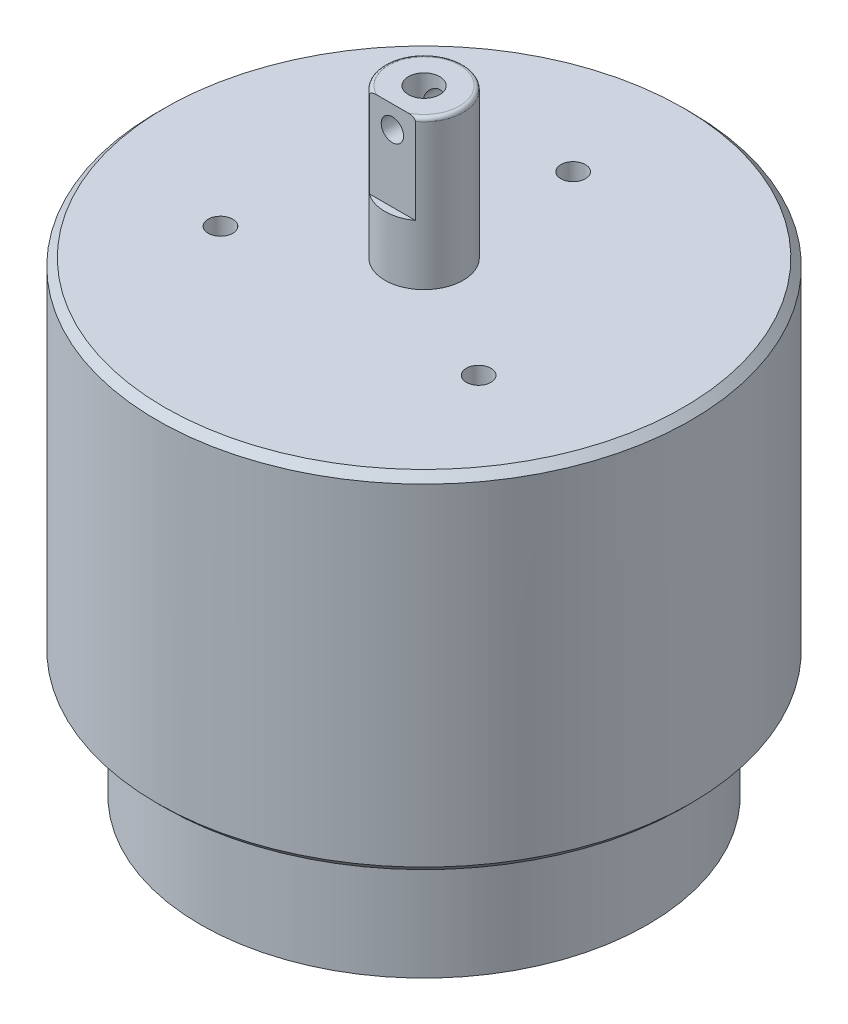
ISO-10303-21;
HEADER;
FILE_DESCRIPTION(('STEP AP214'),'2;1');
FILE_NAME('part.step','',(''),(''),'','','');
FILE_SCHEMA(('AUTOMOTIVE_DESIGN { 1 0 10303 214 1 1 1 1 }'));
ENDSEC;
DATA;
#1=APPLICATION_CONTEXT('core data for automotive mechanical design processes');
#2=APPLICATION_PROTOCOL_DEFINITION('international standard','automotive_design',2000,#1);
#3=PRODUCT_CONTEXT('',#1,'mechanical');
#4=PRODUCT('Part','Part','',(#3));
#5=PRODUCT_RELATED_PRODUCT_CATEGORY('part','',(#4));
#6=PRODUCT_DEFINITION_FORMATION('','',#4);
#7=PRODUCT_DEFINITION_CONTEXT('part definition',#1,'design');
#8=PRODUCT_DEFINITION('design','',#6,#7);
#9=PRODUCT_DEFINITION_SHAPE('','',#8);
#10=(LENGTH_UNIT() NAMED_UNIT(*) SI_UNIT(.MILLI.,.METRE.));
#11=(NAMED_UNIT(*) PLANE_ANGLE_UNIT() SI_UNIT($,.RADIAN.));
#12=(NAMED_UNIT(*) SI_UNIT($,.STERADIAN.) SOLID_ANGLE_UNIT());
#13=UNCERTAINTY_MEASURE_WITH_UNIT(LENGTH_MEASURE(1.E-05),#10,'distance_accuracy_value','');
#14=(GEOMETRIC_REPRESENTATION_CONTEXT(3) GLOBAL_UNCERTAINTY_ASSIGNED_CONTEXT((#13)) GLOBAL_UNIT_ASSIGNED_CONTEXT((#10,
#11,#12)) REPRESENTATION_CONTEXT('',''));
#15=CARTESIAN_POINT('',(0.,0.,0.));
#16=DIRECTION('',(0.,0.,1.));
#17=DIRECTION('',(1.,0.,0.));
#18=AXIS2_PLACEMENT_3D('',#15,#16,#17);
#19=CARTESIAN_POINT('',(0.,-23.25,0.));
#20=DIRECTION('',(0.,1.,0.));
#21=DIRECTION('',(0.,0.,1.));
#22=AXIS2_PLACEMENT_3D('',#19,#20,#21);
#23=PLANE('',#22);
#24=CARTESIAN_POINT('',(0.,-23.25,0.));
#25=DIRECTION('',(0.,1.,0.));
#26=DIRECTION('',(0.,0.,1.));
#27=AXIS2_PLACEMENT_3D('',#24,#25,#26);
#28=CIRCLE('',#27,34.7999999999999);
#29=CARTESIAN_POINT('',(0.,-23.25,34.7999999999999));
#30=VERTEX_POINT('',#29);
#31=EDGE_CURVE('E247',#30,#30,#28,.F.);
#32=ORIENTED_EDGE('',*,*,#31,.T.);
#33=EDGE_LOOP('',(#32));
#34=FACE_BOUND('',#33,.T.);
#35=CARTESIAN_POINT('',(0.,-23.25,0.));
#36=DIRECTION('',(0.,1.,0.));
#37=DIRECTION('',(0.,0.,1.));
#38=AXIS2_PLACEMENT_3D('',#35,#36,#37);
#39=CIRCLE('',#38,30.);
#40=CARTESIAN_POINT('',(0.,-23.25,30.));
#41=VERTEX_POINT('',#40);
#42=EDGE_CURVE('E237',#41,#41,#39,.F.);
#43=ORIENTED_EDGE('',*,*,#42,.F.);
#44=EDGE_LOOP('',(#43));
#45=FACE_BOUND('',#44,.T.);
#46=ADVANCED_FACE('F38',(#34,#45),#23,.F.);
#47=CARTESIAN_POINT('',(0.,23.25,0.));
#48=DIRECTION('',(0.,1.,0.));
#49=DIRECTION('',(0.,0.,1.));
#50=AXIS2_PLACEMENT_3D('',#47,#48,#49);
#51=PLANE('',#50);
#52=CARTESIAN_POINT('',(0.,23.25,0.));
#53=DIRECTION('',(0.,1.,0.));
#54=DIRECTION('',(0.,0.,1.));
#55=AXIS2_PLACEMENT_3D('',#52,#53,#54);
#56=CIRCLE('',#55,34.8000000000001);
#57=CARTESIAN_POINT('',(0.,23.25,34.8000000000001));
#58=VERTEX_POINT('',#57);
#59=EDGE_CURVE('E238',#58,#58,#56,.T.);
#60=ORIENTED_EDGE('',*,*,#59,.T.);
#61=EDGE_LOOP('',(#60));
#62=FACE_BOUND('',#61,.T.);
#63=CARTESIAN_POINT('',(17.3205080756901,23.25,9.99999999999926));
#64=DIRECTION('',(0.,1.,0.));
#65=DIRECTION('',(0.,0.,1.));
#66=AXIS2_PLACEMENT_3D('',#63,#64,#65);
#67=CIRCLE('',#66,1.65);
#68=CARTESIAN_POINT('',(17.3205080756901,23.25,11.6499999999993));
#69=VERTEX_POINT('',#68);
#70=EDGE_CURVE('E128',#69,#69,#67,.T.);
#71=ORIENTED_EDGE('',*,*,#70,.F.);
#72=EDGE_LOOP('',(#71));
#73=FACE_BOUND('',#72,.T.);
#74=CARTESIAN_POINT('',(-17.3205080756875,23.25,10.0000000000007));
#75=DIRECTION('',(0.,1.,0.));
#76=DIRECTION('',(0.,0.,1.));
#77=AXIS2_PLACEMENT_3D('',#74,#75,#76);
#78=CIRCLE('',#77,1.65);
#79=CARTESIAN_POINT('',(-17.3205080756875,23.25,11.6500000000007));
#80=VERTEX_POINT('',#79);
#81=EDGE_CURVE('E122',#80,#80,#78,.T.);
#82=ORIENTED_EDGE('',*,*,#81,.F.);
#83=EDGE_LOOP('',(#82));
#84=FACE_BOUND('',#83,.T.);
#85=CARTESIAN_POINT('',(0.,23.25,-20.));
#86=DIRECTION('',(0.,1.,0.));
#87=DIRECTION('',(0.,0.,1.));
#88=AXIS2_PLACEMENT_3D('',#85,#86,#87);
#89=CIRCLE('',#88,1.65);
#90=CARTESIAN_POINT('',(0.,23.25,-18.35));
#91=VERTEX_POINT('',#90);
#92=EDGE_CURVE('E116',#91,#91,#89,.T.);
#93=ORIENTED_EDGE('',*,*,#92,.F.);
#94=EDGE_LOOP('',(#93));
#95=FACE_BOUND('',#94,.T.);
#96=CARTESIAN_POINT('',(0.,23.25,0.));
#97=DIRECTION('',(0.,1.,0.));
#98=DIRECTION('',(0.,0.,1.));
#99=AXIS2_PLACEMENT_3D('',#96,#97,#98);
#100=CIRCLE('',#99,5.25);
#101=CARTESIAN_POINT('',(0.,23.25,5.25));
#102=VERTEX_POINT('',#101);
#103=EDGE_CURVE('E113',#102,#102,#100,.T.);
#104=ORIENTED_EDGE('',*,*,#103,.F.);
#105=EDGE_LOOP('',(#104));
#106=FACE_BOUND('',#105,.T.);
#107=ADVANCED_FACE('F211',(#62,#73,#84,#95,#106),#51,.T.);
#108=CARTESIAN_POINT('',(0.,23.25,0.));
#109=DIRECTION('',(0.,-1.,0.));
#110=DIRECTION('',(0.,0.,-1.));
#111=AXIS2_PLACEMENT_3D('',#108,#109,#110);
#112=CYLINDRICAL_SURFACE('',#111,35.8);
#113=CARTESIAN_POINT('',(0.,-22.2499999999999,0.));
#114=DIRECTION('',(0.,1.,0.));
#115=DIRECTION('',(0.,0.,1.));
#116=AXIS2_PLACEMENT_3D('',#113,#114,#115);
#117=CIRCLE('',#116,35.8);
#118=CARTESIAN_POINT('',(0.,-22.2499999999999,-35.8));
#119=VERTEX_POINT('',#118);
#120=EDGE_CURVE('E233',#119,#119,#117,.T.);
#121=CARTESIAN_POINT('',(0.,22.25,0.));
#122=DIRECTION('',(0.,1.,0.));
#123=DIRECTION('',(0.,0.,1.));
#124=AXIS2_PLACEMENT_3D('',#121,#122,#123);
#125=CIRCLE('',#124,35.8);
#126=CARTESIAN_POINT('',(0.,22.25,-35.8));
#127=VERTEX_POINT('',#126);
#128=EDGE_CURVE('E236',#127,#127,#125,.F.);
#129=CARTESIAN_POINT('',(0.,-22.2499999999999,-35.8));
#130=CARTESIAN_POINT('',(0.,-21.7864583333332,-35.8));
#131=CARTESIAN_POINT('',(0.,-21.3229166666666,-35.8));
#132=CARTESIAN_POINT('',(0.,-20.3958333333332,-35.8));
#133=CARTESIAN_POINT('',(0.,-19.9322916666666,-35.8));
#134=CARTESIAN_POINT('',(0.,-19.0052083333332,-35.8));
#135=CARTESIAN_POINT('',(0.,-18.5416666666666,-35.8));
#136=CARTESIAN_POINT('',(0.,-17.6145833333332,-35.8));
#137=CARTESIAN_POINT('',(0.,-17.1510416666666,-35.8));
#138=CARTESIAN_POINT('',(0.,-16.2239583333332,-35.8));
#139=CARTESIAN_POINT('',(0.,-15.7604166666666,-35.8));
#140=CARTESIAN_POINT('',(0.,-14.8333333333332,-35.8));
#141=CARTESIAN_POINT('',(0.,-14.3697916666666,-35.8));
#142=CARTESIAN_POINT('',(0.,-13.4427083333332,-35.8));
#143=CARTESIAN_POINT('',(0.,-12.9791666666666,-35.8));
#144=CARTESIAN_POINT('',(0.,-12.0520833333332,-35.8));
#145=CARTESIAN_POINT('',(0.,-11.5885416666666,-35.8));
#146=CARTESIAN_POINT('',(0.,-10.6614583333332,-35.8));
#147=CARTESIAN_POINT('',(0.,-10.1979166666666,-35.8));
#148=CARTESIAN_POINT('',(0.,-9.27083333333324,-35.8));
#149=CARTESIAN_POINT('',(0.,-8.80729166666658,-35.8));
#150=CARTESIAN_POINT('',(0.,-7.88020833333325,-35.8));
#151=CARTESIAN_POINT('',(0.,-7.41666666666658,-35.8));
#152=CARTESIAN_POINT('',(0.,-6.48958333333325,-35.8));
#153=CARTESIAN_POINT('',(0.,-6.02604166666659,-35.8));
#154=CARTESIAN_POINT('',(0.,-5.09895833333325,-35.8));
#155=CARTESIAN_POINT('',(0.,-4.63541666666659,-35.8));
#156=CARTESIAN_POINT('',(0.,-3.70833333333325,-35.8));
#157=CARTESIAN_POINT('',(0.,-3.24479166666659,-35.8));
#158=CARTESIAN_POINT('',(0.,-2.31770833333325,-35.8));
#159=CARTESIAN_POINT('',(0.,-1.85416666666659,-35.8));
#160=CARTESIAN_POINT('',(0.,-0.927083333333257,-35.8));
#161=CARTESIAN_POINT('',(0.,-0.46354166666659,-35.8));
#162=CARTESIAN_POINT('',(0.,0.463541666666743,-35.8));
#163=CARTESIAN_POINT('',(0.,0.927083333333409,-35.8));
#164=CARTESIAN_POINT('',(0.,1.85416666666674,-35.8));
#165=CARTESIAN_POINT('',(0.,2.31770833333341,-35.8));
#166=CARTESIAN_POINT('',(0.,3.24479166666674,-35.8));
#167=CARTESIAN_POINT('',(0.,3.7083333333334,-35.8));
#168=CARTESIAN_POINT('',(0.,4.63541666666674,-35.8));
#169=CARTESIAN_POINT('',(0.,5.0989583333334,-35.8));
#170=CARTESIAN_POINT('',(0.,6.02604166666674,-35.8));
#171=CARTESIAN_POINT('',(0.,6.4895833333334,-35.8));
#172=CARTESIAN_POINT('',(0.,7.41666666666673,-35.8));
#173=CARTESIAN_POINT('',(0.,7.8802083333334,-35.8));
#174=CARTESIAN_POINT('',(0.,8.80729166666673,-35.8));
#175=CARTESIAN_POINT('',(0.,9.27083333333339,-35.8));
#176=CARTESIAN_POINT('',(0.,10.1979166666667,-35.8));
#177=CARTESIAN_POINT('',(0.,10.6614583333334,-35.8));
#178=CARTESIAN_POINT('',(0.,11.5885416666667,-35.8));
#179=CARTESIAN_POINT('',(0.,12.0520833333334,-35.8));
#180=CARTESIAN_POINT('',(0.,12.9791666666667,-35.8));
#181=CARTESIAN_POINT('',(0.,13.4427083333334,-35.8));
#182=CARTESIAN_POINT('',(0.,14.3697916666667,-35.8));
#183=CARTESIAN_POINT('',(0.,14.8333333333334,-35.8));
#184=CARTESIAN_POINT('',(0.,15.7604166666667,-35.8));
#185=CARTESIAN_POINT('',(0.,16.2239583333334,-35.8));
#186=CARTESIAN_POINT('',(0.,17.1510416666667,-35.8));
#187=CARTESIAN_POINT('',(0.,17.6145833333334,-35.8));
#188=CARTESIAN_POINT('',(0.,18.5416666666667,-35.8));
#189=CARTESIAN_POINT('',(0.,19.0052083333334,-35.8));
#190=CARTESIAN_POINT('',(0.,19.9322916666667,-35.8));
#191=CARTESIAN_POINT('',(0.,20.3958333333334,-35.8));
#192=CARTESIAN_POINT('',(0.,21.3229166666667,-35.8));
#193=CARTESIAN_POINT('',(0.,21.7864583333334,-35.8));
#194=CARTESIAN_POINT('',(0.,22.25,-35.8));
#195=B_SPLINE_CURVE_WITH_KNOTS('',3,(#129,#130,#131,#132,#133,#134,#135,#136,#137,#138,#139,
#140,#141,#142,#143,#144,#145,#146,#147,#148,#149,#150,#151,#152,#153,#154,#155,#156,#157,#158,
#159,#160,#161,#162,#163,#164,#165,#166,#167,#168,#169,#170,#171,#172,#173,#174,#175,#176,#177,
#178,#179,#180,#181,#182,#183,#184,#185,#186,#187,#188,#189,#190,#191,#192,#193,#194),
.UNSPECIFIED.,.F.,.F.,(4,2,2,2,2,2,2,2,2,2,2,2,2,2,2,2,2,2,2,2,2,2,2,2,2,2,2,2,2,2,2,2,4),(0.,
1.390625,2.78125,4.17187499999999,5.56249999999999,6.95312499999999,8.34374999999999,
9.73437499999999,11.125,12.515625,13.90625,15.296875,16.6875,18.078125,19.46875,20.859375,22.25,
23.640625,25.03125,26.421875,27.8125,29.203125,30.59375,31.984375,33.375,34.765625,36.15625,
37.546875,38.9375,40.3281249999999,41.7187499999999,43.1093749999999,44.4999999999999),.UNSPECIFIED.);
#196=EDGE_CURVE('BSEAM217',#119,#127,#195,.T.);
#197=ORIENTED_EDGE('',*,*,#120,.T.);
#198=ORIENTED_EDGE('',*,*,#128,.T.);
#199=ORIENTED_EDGE('',*,*,#196,.T.);
#200=ORIENTED_EDGE('',*,*,#196,.F.);
#201=EDGE_LOOP('',(#197,#199,#198,#200));
#202=FACE_BOUND('',#201,.T.);
#203=ADVANCED_FACE('F217',(#202),#112,.T.);
#204=CARTESIAN_POINT('',(17.3205080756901,11.75,9.99999999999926));
#205=DIRECTION('',(0.,1.,0.));
#206=DIRECTION('',(0.,0.,1.));
#207=AXIS2_PLACEMENT_3D('',#204,#205,#206);
#208=CONICAL_SURFACE('',#207,1.65,1.02974425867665);
#209=CARTESIAN_POINT('',(17.3205080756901,10.7585799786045,9.99999999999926));
#210=VERTEX_POINT('',#209);
#211=VERTEX_LOOP('',#210);
#212=FACE_BOUND('',#211,.T.);
#213=CARTESIAN_POINT('',(17.3205080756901,11.75,9.99999999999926));
#214=DIRECTION('',(0.,1.,0.));
#215=DIRECTION('',(0.,0.,1.));
#216=AXIS2_PLACEMENT_3D('',#213,#214,#215);
#217=CIRCLE('',#216,1.65);
#218=CARTESIAN_POINT('',(17.3205080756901,11.75,11.6499999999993));
#219=VERTEX_POINT('',#218);
#220=EDGE_CURVE('E131',#219,#219,#217,.T.);
#221=ORIENTED_EDGE('',*,*,#220,.T.);
#222=EDGE_LOOP('',(#221));
#223=FACE_BOUND('',#222,.T.);
#224=ADVANCED_FACE('F224',(#212,#223),#208,.F.);
#225=CARTESIAN_POINT('',(17.3205080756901,23.25,9.99999999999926));
#226=DIRECTION('',(0.,1.,0.));
#227=DIRECTION('',(0.,0.,1.));
#228=AXIS2_PLACEMENT_3D('',#225,#226,#227);
#229=CYLINDRICAL_SURFACE('',#228,1.65);
#230=ORIENTED_EDGE('',*,*,#220,.F.);
#231=EDGE_LOOP('',(#230));
#232=FACE_BOUND('',#231,.T.);
#233=ORIENTED_EDGE('',*,*,#70,.T.);
#234=EDGE_LOOP('',(#233));
#235=FACE_BOUND('',#234,.T.);
#236=ADVANCED_FACE('F229',(#232,#235),#229,.F.);
#237=CARTESIAN_POINT('',(-17.3205080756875,11.75,10.0000000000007));
#238=DIRECTION('',(0.,1.,0.));
#239=DIRECTION('',(0.,0.,1.));
#240=AXIS2_PLACEMENT_3D('',#237,#238,#239);
#241=CONICAL_SURFACE('',#240,1.65,1.02974425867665);
#242=CARTESIAN_POINT('',(-17.3205080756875,10.7585799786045,10.0000000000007));
#243=VERTEX_POINT('',#242);
#244=VERTEX_LOOP('',#243);
#245=FACE_BOUND('',#244,.T.);
#246=CARTESIAN_POINT('',(-17.3205080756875,11.75,10.0000000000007));
#247=DIRECTION('',(0.,1.,0.));
#248=DIRECTION('',(0.,0.,1.));
#249=AXIS2_PLACEMENT_3D('',#246,#247,#248);
#250=CIRCLE('',#249,1.65);
#251=CARTESIAN_POINT('',(-17.3205080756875,11.75,11.6500000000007));
#252=VERTEX_POINT('',#251);
#253=EDGE_CURVE('E125',#252,#252,#250,.T.);
#254=ORIENTED_EDGE('',*,*,#253,.T.);
#255=EDGE_LOOP('',(#254));
#256=FACE_BOUND('',#255,.T.);
#257=ADVANCED_FACE('F388',(#245,#256),#241,.F.);
#258=CARTESIAN_POINT('',(-17.3205080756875,23.25,10.0000000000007));
#259=DIRECTION('',(0.,1.,0.));
#260=DIRECTION('',(0.,0.,1.));
#261=AXIS2_PLACEMENT_3D('',#258,#259,#260);
#262=CYLINDRICAL_SURFACE('',#261,1.65);
#263=ORIENTED_EDGE('',*,*,#253,.F.);
#264=EDGE_LOOP('',(#263));
#265=FACE_BOUND('',#264,.T.);
#266=ORIENTED_EDGE('',*,*,#81,.T.);
#267=EDGE_LOOP('',(#266));
#268=FACE_BOUND('',#267,.T.);
#269=ADVANCED_FACE('F397',(#265,#268),#262,.F.);
#270=CARTESIAN_POINT('',(0.,11.75,-20.));
#271=DIRECTION('',(0.,1.,0.));
#272=DIRECTION('',(0.,0.,1.));
#273=AXIS2_PLACEMENT_3D('',#270,#271,#272);
#274=CONICAL_SURFACE('',#273,1.65,1.02974425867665);
#275=CARTESIAN_POINT('',(0.,10.7585799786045,-20.));
#276=VERTEX_POINT('',#275);
#277=VERTEX_LOOP('',#276);
#278=FACE_BOUND('',#277,.T.);
#279=CARTESIAN_POINT('',(0.,11.75,-20.));
#280=DIRECTION('',(0.,1.,0.));
#281=DIRECTION('',(0.,0.,1.));
#282=AXIS2_PLACEMENT_3D('',#279,#280,#281);
#283=CIRCLE('',#282,1.65);
#284=CARTESIAN_POINT('',(0.,11.75,-18.35));
#285=VERTEX_POINT('',#284);
#286=EDGE_CURVE('E119',#285,#285,#283,.T.);
#287=ORIENTED_EDGE('',*,*,#286,.T.);
#288=EDGE_LOOP('',(#287));
#289=FACE_BOUND('',#288,.T.);
#290=ADVANCED_FACE('F406',(#278,#289),#274,.F.);
#291=CARTESIAN_POINT('',(0.,23.25,-20.));
#292=DIRECTION('',(0.,1.,0.));
#293=DIRECTION('',(0.,0.,1.));
#294=AXIS2_PLACEMENT_3D('',#291,#292,#293);
#295=CYLINDRICAL_SURFACE('',#294,1.65);
#296=ORIENTED_EDGE('',*,*,#286,.F.);
#297=EDGE_LOOP('',(#296));
#298=FACE_BOUND('',#297,.T.);
#299=ORIENTED_EDGE('',*,*,#92,.T.);
#300=EDGE_LOOP('',(#299));
#301=FACE_BOUND('',#300,.T.);
#302=ADVANCED_FACE('F171',(#298,#301),#295,.F.);
#303=CARTESIAN_POINT('',(0.,43.25,0.));
#304=DIRECTION('',(0.,-1.,0.));
#305=DIRECTION('',(0.,0.,-1.));
#306=AXIS2_PLACEMENT_3D('',#303,#304,#305);
#307=CYLINDRICAL_SURFACE('',#306,5.25);
#308=CARTESIAN_POINT('',(0.,41.75,-5.25));
#309=CARTESIAN_POINT('',(-0.0824661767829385,41.7499985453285,-5.24999901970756));
#310=CARTESIAN_POINT('',(-0.164947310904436,41.7431766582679,-5.24803813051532));
#311=CARTESIAN_POINT('',(-0.327518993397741,41.7161267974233,-5.24040679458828));
#312=CARTESIAN_POINT('',(-0.407608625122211,41.6958937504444,-5.23473494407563));
#313=CARTESIAN_POINT('',(-0.563028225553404,41.6427439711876,-5.22030518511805));
#314=CARTESIAN_POINT('',(-0.638364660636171,41.609844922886,-5.21155158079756));
#315=CARTESIAN_POINT('',(-0.782451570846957,41.5323665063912,-5.19187483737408));
#316=CARTESIAN_POINT('',(-0.851201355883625,41.4877859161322,-5.18095147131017));
#317=CARTESIAN_POINT('',(-0.98197083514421,41.3869737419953,-5.15778550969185));
#318=CARTESIAN_POINT('',(-1.04379279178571,41.3304914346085,-5.14551781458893));
#319=CARTESIAN_POINT('',(-1.15722851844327,41.2080141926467,-5.12120051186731));
#320=CARTESIAN_POINT('',(-1.20884075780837,41.1420178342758,-5.10915093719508));
#321=CARTESIAN_POINT('',(-1.30139842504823,41.0007548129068,-5.08637261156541));
#322=CARTESIAN_POINT('',(-1.34210865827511,40.9253285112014,-5.07567526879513));
#323=CARTESIAN_POINT('',(-1.41018877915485,40.7683459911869,-5.057185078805));
#324=CARTESIAN_POINT('',(-1.43756153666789,40.6867910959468,-5.04939160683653));
#325=CARTESIAN_POINT('',(-1.47748824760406,40.5220739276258,-5.03785206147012));
#326=CARTESIAN_POINT('',(-1.49040414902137,40.4390064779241,-5.03400733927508));
#327=CARTESIAN_POINT('',(-1.50218000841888,40.2718016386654,-5.03050656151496));
#328=CARTESIAN_POINT('',(-1.50104302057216,40.1876644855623,-5.03084959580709));
#329=CARTESIAN_POINT('',(-1.48503101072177,40.0235985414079,-5.0355977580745));
#330=CARTESIAN_POINT('',(-1.47060244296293,39.9436217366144,-5.03987087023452));
#331=CARTESIAN_POINT('',(-1.42913539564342,39.7872745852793,-5.05178511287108));
#332=CARTESIAN_POINT('',(-1.40209577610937,39.7109045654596,-5.05942654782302));
#333=CARTESIAN_POINT('',(-1.33583010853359,39.5628153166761,-5.0773264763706));
#334=CARTESIAN_POINT('',(-1.29645413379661,39.4911671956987,-5.08761687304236));
#335=CARTESIAN_POINT('',(-1.20673784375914,39.3553425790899,-5.10963912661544));
#336=CARTESIAN_POINT('',(-1.15639508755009,39.2911677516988,-5.12137130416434));
#337=CARTESIAN_POINT('',(-1.04392799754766,39.1695707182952,-5.14549687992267));
#338=CARTESIAN_POINT('',(-0.981431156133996,39.1124941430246,-5.15789853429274));
#339=CARTESIAN_POINT('',(-0.847599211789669,39.0095554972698,-5.18157185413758));
#340=CARTESIAN_POINT('',(-0.776263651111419,38.9636940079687,-5.19284346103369));
#341=CARTESIAN_POINT('',(-0.626192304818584,38.8843034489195,-5.21307396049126));
#342=CARTESIAN_POINT('',(-0.547417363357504,38.8508447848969,-5.22201956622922));
#343=CARTESIAN_POINT('',(-0.385044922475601,38.7977495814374,-5.23649438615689));
#344=CARTESIAN_POINT('',(-0.301448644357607,38.778109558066,-5.24202446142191));
#345=CARTESIAN_POINT('',(-0.134749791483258,38.7537700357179,-5.24891155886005));
#346=CARTESIAN_POINT('',(-0.0517210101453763,38.7486014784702,-5.25039954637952));
#347=CARTESIAN_POINT('',(0.11401989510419,38.7520454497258,-5.24941563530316));
#348=CARTESIAN_POINT('',(0.196732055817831,38.7606563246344,-5.24694421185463));
#349=CARTESIAN_POINT('',(0.357763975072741,38.7910328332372,-5.23840445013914));
#350=CARTESIAN_POINT('',(0.436138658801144,38.8125298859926,-5.23240959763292));
#351=CARTESIAN_POINT('',(0.588156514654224,38.8677503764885,-5.21750999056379));
#352=CARTESIAN_POINT('',(0.661799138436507,38.9014752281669,-5.20860489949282));
#353=CARTESIAN_POINT('',(0.804031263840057,38.9810175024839,-5.18857470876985));
#354=CARTESIAN_POINT('',(0.872476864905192,39.0270808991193,-5.17740572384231));
#355=CARTESIAN_POINT('',(1.00082889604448,39.129689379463,-5.15413460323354));
#356=CARTESIAN_POINT('',(1.06073337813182,39.1862368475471,-5.14203225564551));
#357=CARTESIAN_POINT('',(1.17232982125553,39.3104070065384,-5.1177646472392));
#358=CARTESIAN_POINT('',(1.22368907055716,39.3783314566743,-5.10561027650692));
#359=CARTESIAN_POINT('',(1.31429648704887,39.5220969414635,-5.08304171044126));
#360=CARTESIAN_POINT('',(1.35354507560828,39.5979377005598,-5.0726274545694));
#361=CARTESIAN_POINT('',(1.41853090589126,39.7550684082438,-5.05483988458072));
#362=CARTESIAN_POINT('',(1.44433974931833,39.8363268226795,-5.04745050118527));
#363=CARTESIAN_POINT('',(1.48184587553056,40.0022824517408,-5.03656842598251));
#364=CARTESIAN_POINT('',(1.49354743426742,40.0869786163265,-5.0330745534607));
#365=CARTESIAN_POINT('',(1.50223518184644,40.2539720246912,-5.03048777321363));
#366=CARTESIAN_POINT('',(1.49976020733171,40.3362391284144,-5.03123370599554));
#367=CARTESIAN_POINT('',(1.48143533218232,40.4991310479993,-5.03665947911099));
#368=CARTESIAN_POINT('',(1.4655858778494,40.5797559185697,-5.04133918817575));
#369=CARTESIAN_POINT('',(1.42129476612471,40.7362837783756,-5.05400232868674));
#370=CARTESIAN_POINT('',(1.39298318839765,40.8122265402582,-5.06195157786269));
#371=CARTESIAN_POINT('',(1.32467211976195,40.9583440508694,-5.08025477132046));
#372=CARTESIAN_POINT('',(1.28467056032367,41.028517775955,-5.0906091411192));
#373=CARTESIAN_POINT('',(1.19254909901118,41.1636376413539,-5.11298751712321));
#374=CARTESIAN_POINT('',(1.14006920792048,41.2283310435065,-5.12505572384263));
#375=CARTESIAN_POINT('',(1.02514488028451,41.3481679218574,-5.14927383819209));
#376=CARTESIAN_POINT('',(0.962697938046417,41.4033089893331,-5.16142376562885));
#377=CARTESIAN_POINT('',(0.827680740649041,41.503877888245,-5.18480969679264));
#378=CARTESIAN_POINT('',(0.754891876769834,41.5490202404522,-5.19601425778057));
#379=CARTESIAN_POINT('',(0.602437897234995,41.6263593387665,-5.21588546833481));
#380=CARTESIAN_POINT('',(0.522776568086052,41.6585631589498,-5.22455350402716));
#381=CARTESIAN_POINT('',(0.369687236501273,41.7056356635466,-5.2374550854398));
#382=CARTESIAN_POINT('',(0.29682225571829,41.7222301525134,-5.24212263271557));
#383=CARTESIAN_POINT('',(0.149308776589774,41.7444122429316,-5.24839532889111));
#384=CARTESIAN_POINT('',(0.0746605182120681,41.7500013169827,-5.25000088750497));
#385=CARTESIAN_POINT('',(0.,41.75,-5.25));
#386=B_SPLINE_CURVE_WITH_KNOTS('',3,(#308,#309,#310,#311,#312,#313,#314,#315,#316,#317,#318,
#319,#320,#321,#322,#323,#324,#325,#326,#327,#328,#329,#330,#331,#332,#333,#334,#335,#336,#337,
#338,#339,#340,#341,#342,#343,#344,#345,#346,#347,#348,#349,#350,#351,#352,#353,#354,#355,#356,
#357,#358,#359,#360,#361,#362,#363,#364,#365,#366,#367,#368,#369,#370,#371,#372,#373,#374,#375,
#376,#377,#378,#379,#380,#381,#382,#383,#384,#385),.UNSPECIFIED.,.T.,.F.,(4,2,2,2,2,2,2,2,2,2,2,
2,2,2,2,2,2,2,2,2,2,2,2,2,2,2,2,2,2,2,2,2,2,2,2,2,2,2,4),(0.,0.247124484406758,
0.494342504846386,0.741216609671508,0.988116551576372,1.24085858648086,1.49363848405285,
1.75149806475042,2.00930213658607,2.26049632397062,2.51163591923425,2.75463589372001,
2.99765783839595,3.24375602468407,3.48990904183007,3.74533875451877,4.00078170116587,
4.25765325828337,4.5144600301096,4.76284093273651,5.01119203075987,5.2545385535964,
5.49791322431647,5.74655644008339,5.99525627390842,6.25209078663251,6.50891636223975,
6.76435930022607,7.01972479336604,7.26545011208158,7.51116723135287,7.75437822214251,
7.99763227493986,8.24900742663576,8.50044587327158,8.75833484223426,9.01608261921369,
9.23984601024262,9.46357945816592),.UNSPECIFIED.);
#387=CARTESIAN_POINT('',(0.,41.75,-5.25));
#388=VERTEX_POINT('',#387);
#389=EDGE_CURVE('E103',#388,#388,#386,.T.);
#390=ORIENTED_EDGE('',*,*,#389,.T.);
#391=EDGE_LOOP('',(#390));
#392=FACE_BOUND('',#391,.T.);
#393=CARTESIAN_POINT('',(0.,42.75,0.));
#394=DIRECTION('',(0.,1.,0.));
#395=DIRECTION('',(0.,0.,1.));
#396=AXIS2_PLACEMENT_3D('',#393,#394,#395);
#397=CIRCLE('',#396,5.25);
#398=CARTESIAN_POINT('',(-3.08220700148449,42.75,4.25));
#399=VERTEX_POINT('',#398);
#400=CARTESIAN_POINT('',(3.08220700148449,42.75,4.25));
#401=VERTEX_POINT('',#400);
#402=EDGE_CURVE('E137',#399,#401,#397,.F.);
#403=ORIENTED_EDGE('',*,*,#402,.T.);
#404=DIRECTION('',(0.,-1.,0.));
#405=VECTOR('',#404,1.);
#406=CARTESIAN_POINT('',(3.08220700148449,43.25,4.25));
#407=LINE('',#406,#405);
#408=CARTESIAN_POINT('',(3.08220700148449,31.25,4.25));
#409=VERTEX_POINT('',#408);
#410=EDGE_CURVE('E59',#401,#409,#407,.T.);
#411=ORIENTED_EDGE('',*,*,#410,.T.);
#412=CARTESIAN_POINT('',(0.,31.25,0.));
#413=DIRECTION('',(0.,1.,0.));
#414=DIRECTION('',(0.,0.,1.));
#415=AXIS2_PLACEMENT_3D('',#412,#413,#414);
#416=CIRCLE('',#415,5.25);
#417=CARTESIAN_POINT('',(-3.08220700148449,31.25,4.25));
#418=VERTEX_POINT('',#417);
#419=EDGE_CURVE('E243',#418,#409,#416,.T.);
#420=ORIENTED_EDGE('',*,*,#419,.F.);
#421=DIRECTION('',(0.,-1.,0.));
#422=VECTOR('',#421,1.);
#423=CARTESIAN_POINT('',(-3.08220700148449,43.25,4.25));
#424=LINE('',#423,#422);
#425=EDGE_CURVE('E110',#418,#399,#424,.F.);
#426=ORIENTED_EDGE('',*,*,#425,.T.);
#427=EDGE_LOOP('',(#403,#411,#420,#426));
#428=FACE_BOUND('',#427,.T.);
#429=ORIENTED_EDGE('',*,*,#103,.T.);
#430=EDGE_LOOP('',(#429));
#431=FACE_BOUND('',#430,.T.);
#432=ADVANCED_FACE('F166',(#392,#428,#431),#307,.T.);
#433=CARTESIAN_POINT('',(0.,43.25,0.));
#434=DIRECTION('',(0.,1.,0.));
#435=DIRECTION('',(0.,0.,1.));
#436=AXIS2_PLACEMENT_3D('',#433,#434,#435);
#437=PLANE('',#436);
#438=CARTESIAN_POINT('',(0.,43.25,0.));
#439=DIRECTION('',(0.,1.,0.));
#440=DIRECTION('',(0.,0.,1.));
#441=AXIS2_PLACEMENT_3D('',#438,#439,#440);
#442=CIRCLE('',#441,2.1);
#443=CARTESIAN_POINT('',(0.,43.25,2.1));
#444=VERTEX_POINT('',#443);
#445=EDGE_CURVE('E98',#444,#444,#442,.T.);
#446=ORIENTED_EDGE('',*,*,#445,.F.);
#447=EDGE_LOOP('',(#446));
#448=FACE_BOUND('',#447,.T.);
#449=DIRECTION('',(-1.,0.,0.));
#450=VECTOR('',#449,1.);
#451=CARTESIAN_POINT('',(-4.81397373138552,43.25,4.25));
#452=LINE('',#451,#450);
#453=CARTESIAN_POINT('',(2.12132034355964,43.25,4.25));
#454=VERTEX_POINT('',#453);
#455=CARTESIAN_POINT('',(-2.12132034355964,43.25,4.25));
#456=VERTEX_POINT('',#455);
#457=EDGE_CURVE('E97',#454,#456,#452,.T.);
#458=ORIENTED_EDGE('',*,*,#457,.F.);
#459=CARTESIAN_POINT('',(0.,43.25,0.));
#460=DIRECTION('',(0.,1.,0.));
#461=DIRECTION('',(0.,0.,1.));
#462=AXIS2_PLACEMENT_3D('',#459,#460,#461);
#463=CIRCLE('',#462,4.75);
#464=EDGE_CURVE('E134',#454,#456,#463,.T.);
#465=ORIENTED_EDGE('',*,*,#464,.T.);
#466=EDGE_LOOP('',(#458,#465));
#467=FACE_BOUND('',#466,.T.);
#468=ADVANCED_FACE('F162',(#448,#467),#437,.T.);
#469=CARTESIAN_POINT('',(0.,42.75,0.));
#470=DIRECTION('',(0.,1.,0.));
#471=DIRECTION('',(0.,0.,1.));
#472=AXIS2_PLACEMENT_3D('',#469,#470,#471);
#473=TOROIDAL_SURFACE('',#472,4.75,0.5);
#474=CARTESIAN_POINT('',(0.,42.75,4.25));
#475=CARTESIAN_POINT('',(8.39505267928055E-11,42.7500008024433,4.25));
#476=CARTESIAN_POINT('',(-2.0855943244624E-07,42.7500016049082,4.25));
#477=CARTESIAN_POINT('',(-8.41681350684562E-07,42.7500031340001,4.25));
#478=CARTESIAN_POINT('',(-1.27523539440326E-06,42.7500038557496,4.25));
#479=CARTESIAN_POINT('',(-2.31169091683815E-06,42.7500053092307,4.25));
#480=CARTESIAN_POINT('',(-2.92912129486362E-06,42.7500060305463,4.25));
#481=CARTESIAN_POINT('',(-4.24350277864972E-06,42.7500073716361,4.25));
#482=CARTESIAN_POINT('',(-4.93919948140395E-06,42.7500079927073,4.25));
#483=CARTESIAN_POINT('',(-7.4947205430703E-06,42.7500101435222,4.25));
#484=CARTESIAN_POINT('',(-9.45509958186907E-06,42.7500115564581,4.25));
#485=CARTESIAN_POINT('',(-1.34494404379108E-05,42.7500140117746,4.25));
#486=CARTESIAN_POINT('',(-1.54745404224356E-05,42.7500150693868,4.25));
#487=CARTESIAN_POINT('',(-2.36016520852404E-05,42.750019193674,4.25));
#488=CARTESIAN_POINT('',(-2.98043528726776E-05,42.7500220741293,4.25));
#489=CARTESIAN_POINT('',(-4.18620233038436E-05,42.7500266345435,4.25));
#490=CARTESIAN_POINT('',(-4.76811680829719E-05,42.7500284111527,4.25));
#491=CARTESIAN_POINT('',(-7.30651751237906E-05,42.7500362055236,4.25));
#492=CARTESIAN_POINT('',(-9.25863820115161E-05,42.7500423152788,4.25));
#493=CARTESIAN_POINT('',(-0.000128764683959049,42.7500518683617,4.25));
#494=CARTESIAN_POINT('',(-0.000145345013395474,42.7500555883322,4.25));
#495=CARTESIAN_POINT('',(-0.000268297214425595,42.7500856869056,4.25));
#496=CARTESIAN_POINT('',(-0.000370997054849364,42.7501249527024,4.25));
#497=CARTESIAN_POINT('',(-0.00077404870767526,42.7502735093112,4.25));
#498=CARTESIAN_POINT('',(-0.00107695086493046,42.7503731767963,4.25));
#499=CARTESIAN_POINT('',(-0.00226594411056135,42.7507700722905,4.25));
#500=CARTESIAN_POINT('',(-0.00314943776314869,42.7510773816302,4.25));
#501=CARTESIAN_POINT('',(-0.00679779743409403,42.7523406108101,4.25));
#502=CARTESIAN_POINT('',(-0.00956550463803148,42.75328518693,4.25));
#503=CARTESIAN_POINT('',(-0.055829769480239,42.769082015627,4.25000000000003));
#504=CARTESIAN_POINT('',(-0.0993010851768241,42.7840366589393,4.25000000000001));
#505=CARTESIAN_POINT('',(-0.18460775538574,42.813213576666,4.24999999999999));
#506=CARTESIAN_POINT('',(-0.226441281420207,42.8274417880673,4.25));
#507=CARTESIAN_POINT('',(-0.315273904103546,42.8574681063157,4.25));
#508=CARTESIAN_POINT('',(-0.362280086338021,42.8732457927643,4.25));
#509=CARTESIAN_POINT('',(-0.456904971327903,42.9046304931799,4.25));
#510=CARTESIAN_POINT('',(-0.504524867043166,42.9202339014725,4.25));
#511=CARTESIAN_POINT('',(-0.621402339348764,42.9579035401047,4.25));
#512=CARTESIAN_POINT('',(-0.690742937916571,42.9797144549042,4.25));
#513=CARTESIAN_POINT('',(-0.828142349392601,43.0214368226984,4.25));
#514=CARTESIAN_POINT('',(-0.896190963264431,43.0413817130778,4.25));
#515=CARTESIAN_POINT('',(-1.04694336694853,43.0835009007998,4.25));
#516=CARTESIAN_POINT('',(-1.12975925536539,43.1052795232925,4.25));
#517=CARTESIAN_POINT('',(-1.29684342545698,43.1456281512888,4.25));
#518=CARTESIAN_POINT('',(-1.38111795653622,43.1641726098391,4.25));
#519=CARTESIAN_POINT('',(-1.55663518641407,43.1979829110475,4.25));
#520=CARTESIAN_POINT('',(-1.64794370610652,43.212917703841,4.25));
#521=CARTESIAN_POINT('',(-1.83119605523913,43.2359965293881,4.25));
#522=CARTESIAN_POINT('',(-1.92313749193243,43.2441588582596,4.25));
#523=CARTESIAN_POINT('',(-2.1053996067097,43.25144504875,4.25));
#524=CARTESIAN_POINT('',(-2.19570931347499,43.2507711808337,4.25));
#525=CARTESIAN_POINT('',(-2.32985303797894,43.2410407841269,4.25));
#526=CARTESIAN_POINT('',(-2.37400922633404,43.2364128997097,4.25));
#527=CARTESIAN_POINT('',(-2.4618216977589,43.2237827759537,4.25));
#528=CARTESIAN_POINT('',(-2.50547835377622,43.2157832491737,4.25));
#529=CARTESIAN_POINT('',(-2.58977437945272,43.1962236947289,4.25));
#530=CARTESIAN_POINT('',(-2.63045733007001,43.1848554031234,4.25));
#531=CARTESIAN_POINT('',(-2.71048191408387,43.1576379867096,4.25));
#532=CARTESIAN_POINT('',(-2.74981940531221,43.141776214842,4.25));
#533=CARTESIAN_POINT('',(-2.81977679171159,43.1075612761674,4.25));
#534=CARTESIAN_POINT('',(-2.85078455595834,43.0900126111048,4.25));
#535=CARTESIAN_POINT('',(-2.909720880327,43.0503438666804,4.25));
#536=CARTESIAN_POINT('',(-2.93765889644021,43.0282384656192,4.25));
#537=CARTESIAN_POINT('',(-2.97861520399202,42.9884185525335,4.25));
#538=CARTESIAN_POINT('',(-2.99321299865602,42.9723347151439,4.25));
#539=CARTESIAN_POINT('',(-3.01984987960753,42.938156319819,4.25));
#540=CARTESIAN_POINT('',(-3.03189192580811,42.9200641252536,4.25));
#541=CARTESIAN_POINT('',(-3.05089400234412,42.8851607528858,4.25));
#542=CARTESIAN_POINT('',(-3.05836451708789,42.86862990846,4.25));
#543=CARTESIAN_POINT('',(-3.07045304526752,42.8345500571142,4.25));
#544=CARTESIAN_POINT('',(-3.07507319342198,42.8170018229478,4.25));
#545=CARTESIAN_POINT('',(-3.08109516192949,42.7812538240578,4.25));
#546=CARTESIAN_POINT('',(-3.08247954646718,42.7630510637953,4.25));
#547=CARTESIAN_POINT('',(-3.08184509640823,42.7267057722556,4.25));
#548=CARTESIAN_POINT('',(-3.07982641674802,42.7085632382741,4.25));
#549=CARTESIAN_POINT('',(-3.07288915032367,42.6744643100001,4.25));
#550=CARTESIAN_POINT('',(-3.06823191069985,42.6584532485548,4.25));
#551=CARTESIAN_POINT('',(-3.05655619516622,42.6273259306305,4.25));
#552=CARTESIAN_POINT('',(-3.04953693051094,42.6122099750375,4.25));
#553=CARTESIAN_POINT('',(-3.03009027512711,42.5768372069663,4.25));
#554=CARTESIAN_POINT('',(-3.01663383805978,42.5571466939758,4.25));
#555=CARTESIAN_POINT('',(-2.98674601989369,42.520165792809,4.25));
#556=CARTESIAN_POINT('',(-2.97030720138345,42.502881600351,4.25));
#557=CARTESIAN_POINT('',(-2.92607807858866,42.4621263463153,4.25));
#558=CARTESIAN_POINT('',(-2.89687363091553,42.4402002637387,4.25));
#559=CARTESIAN_POINT('',(-2.83555786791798,42.4010411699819,4.25));
#560=CARTESIAN_POINT('',(-2.80344428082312,42.3838118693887,4.25));
#561=CARTESIAN_POINT('',(-2.74157384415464,42.3551842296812,4.25));
#562=CARTESIAN_POINT('',(-2.71202530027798,42.3433259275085,4.25));
#563=CARTESIAN_POINT('',(-2.65201180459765,42.3221784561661,4.25));
#564=CARTESIAN_POINT('',(-2.62154612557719,42.3128913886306,4.25));
#565=CARTESIAN_POINT('',(-2.52870197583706,42.2882017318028,4.25));
#566=CARTESIAN_POINT('',(-2.46541728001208,42.2762016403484,4.25));
#567=CARTESIAN_POINT('',(-2.33710680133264,42.258975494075,4.25));
#568=CARTESIAN_POINT('',(-2.27206907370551,42.2538498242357,4.25));
#569=CARTESIAN_POINT('',(-2.14167546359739,42.2491685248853,4.25));
#570=CARTESIAN_POINT('',(-2.07631919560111,42.2496252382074,4.25));
#571=CARTESIAN_POINT('',(-1.94851007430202,42.2549210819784,4.25));
#572=CARTESIAN_POINT('',(-1.88604869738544,42.2595785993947,4.25));
#573=CARTESIAN_POINT('',(-1.76179905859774,42.2722552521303,4.25));
#574=CARTESIAN_POINT('',(-1.700008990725,42.2802573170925,4.25));
#575=CARTESIAN_POINT('',(-1.51873239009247,42.3078852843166,4.25));
#576=CARTESIAN_POINT('',(-1.39983035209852,42.3313539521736,4.25));
#577=CARTESIAN_POINT('',(-1.22146487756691,42.3722567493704,4.25));
#578=CARTESIAN_POINT('',(-1.16134973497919,42.3870353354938,4.25));
#579=CARTESIAN_POINT('',(-1.04136805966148,42.4181900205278,4.25));
#580=CARTESIAN_POINT('',(-0.981502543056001,42.4345700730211,4.25));
#581=CARTESIAN_POINT('',(-0.84089803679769,42.4746367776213,4.25));
#582=CARTESIAN_POINT('',(-0.760310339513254,42.498849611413,4.25));
#583=CARTESIAN_POINT('',(-0.600506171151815,42.5486387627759,4.25));
#584=CARTESIAN_POINT('',(-0.521284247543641,42.574197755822,4.25));
#585=CARTESIAN_POINT('',(-0.371828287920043,42.6234861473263,4.25));
#586=CARTESIAN_POINT('',(-0.301559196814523,42.6471097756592,4.25000000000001));
#587=CARTESIAN_POINT('',(-0.194546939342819,42.6834116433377,4.25));
#588=CARTESIAN_POINT('',(-0.157755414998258,42.695951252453,4.24999999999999));
#589=CARTESIAN_POINT('',(-0.0847609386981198,42.7209465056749,4.25000000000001));
#590=CARTESIAN_POINT('',(-0.0485575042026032,42.7334005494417,4.25000000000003));
#591=CARTESIAN_POINT('',(-0.00956346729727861,42.7467155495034,4.25));
#592=CARTESIAN_POINT('',(-0.00679370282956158,42.7476607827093,4.25));
#593=CARTESIAN_POINT('',(-0.00314486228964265,42.7489241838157,4.25));
#594=CARTESIAN_POINT('',(-0.00226292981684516,42.7492309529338,4.25));
#595=CARTESIAN_POINT('',(-0.0010759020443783,42.7496271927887,4.25));
#596=CARTESIAN_POINT('',(-0.000773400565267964,42.7497267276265,4.25));
#597=CARTESIAN_POINT('',(-0.000370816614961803,42.7498751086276,4.25));
#598=CARTESIAN_POINT('',(-0.000268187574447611,42.749914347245,4.25));
#599=CARTESIAN_POINT('',(-0.000145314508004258,42.7499444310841,4.25));
#600=CARTESIAN_POINT('',(-0.00012873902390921,42.749948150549,4.25));
#601=CARTESIAN_POINT('',(-9.25716164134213E-05,42.7499577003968,4.25));
#602=CARTESIAN_POINT('',(-7.30563315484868E-05,42.7499638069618,4.25));
#603=CARTESIAN_POINT('',(-4.76789428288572E-05,42.7499715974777,4.25));
#604=CARTESIAN_POINT('',(-4.18605026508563E-05,42.7499733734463,4.25));
#605=CARTESIAN_POINT('',(-2.98041990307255E-05,42.7499779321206,4.25));
#606=CARTESIAN_POINT('',(-2.3602131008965E-05,42.7499808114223,4.25));
#607=CARTESIAN_POINT('',(-1.54756359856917E-05,42.7499849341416,4.25));
#608=CARTESIAN_POINT('',(-1.34505898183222E-05,42.7499859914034,4.25));
#609=CARTESIAN_POINT('',(-9.45629000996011E-06,42.7499884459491,4.25));
#610=CARTESIAN_POINT('',(-7.49589337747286E-06,42.7499898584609,4.25));
#611=CARTESIAN_POINT('',(-4.94026967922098E-06,42.7499920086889,4.25));
#612=CARTESIAN_POINT('',(-4.24452711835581E-06,42.7499926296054,4.25));
#613=CARTESIAN_POINT('',(-2.93002606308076E-06,42.7499939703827,4.25));
#614=CARTESIAN_POINT('',(-2.31252147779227E-06,42.7499946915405,4.25));
#615=CARTESIAN_POINT('',(-1.27588775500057E-06,42.7499961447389,4.25));
#616=CARTESIAN_POINT('',(-8.42234455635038E-07,42.7499968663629,4.25));
#617=CARTESIAN_POINT('',(-2.08868934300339E-07,42.7499983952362,4.25));
#618=CARTESIAN_POINT('',(-8.39452397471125E-11,42.7499991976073,4.25));
#619=CARTESIAN_POINT('',(0.,42.75,4.25));
#620=B_SPLINE_CURVE_WITH_KNOTS('',3,(#474,#475,#476,#477,#478,#479,#480,#481,#482,#483,#484,
#485,#486,#487,#488,#489,#490,#491,#492,#493,#494,#495,#496,#497,#498,#499,#500,#501,#502,#503,
#504,#505,#506,#507,#508,#509,#510,#511,#512,#513,#514,#515,#516,#517,#518,#519,#520,#521,#522,
#523,#524,#525,#526,#527,#528,#529,#530,#531,#532,#533,#534,#535,#536,#537,#538,#539,#540,#541,
#542,#543,#544,#545,#546,#547,#548,#549,#550,#551,#552,#553,#554,#555,#556,#557,#558,#559,#560,
#561,#562,#563,#564,#565,#566,#567,#568,#569,#570,#571,#572,#573,#574,#575,#576,#577,#578,#579,
#580,#581,#582,#583,#584,#585,#586,#587,#588,#589,#590,#591,#592,#593,#594,#595,#596,#597,#598,
#599,#600,#601,#602,#603,#604,#605,#606,#607,#608,#609,#610,#611,#612,#613,#614,#615,#616,#617,
#618,#619),.UNSPECIFIED.,.T.,.F.,(4,2,2,2,2,2,2,2,2,2,2,2,2,2,2,2,2,2,2,2,2,2,2,2,2,2,2,2,2,2,2,
2,2,2,2,2,2,2,2,2,2,2,2,2,2,2,2,2,2,2,2,2,2,2,2,2,2,2,2,2,2,2,2,2,2,2,2,2,2,2,2,2,4),(0.,
2.40943913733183E-06,4.92468247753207E-06,7.75998154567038E-06,1.05549986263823E-05,
1.77716207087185E-05,2.46199269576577E-05,4.50839142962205E-05,6.33166493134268E-05,
0.000124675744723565,0.000175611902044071,0.000504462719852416,0.00146193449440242,
0.00426711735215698,0.0130416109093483,0.150944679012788,0.283508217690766,0.432256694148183,
0.582588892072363,0.800647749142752,1.01336611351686,1.27020681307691,1.52899250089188,
1.80636092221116,2.0829775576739,2.35327340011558,2.48636771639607,2.6193551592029,
2.74588550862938,2.872775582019,2.979366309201,3.08561890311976,3.15059139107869,
3.21548821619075,3.26968895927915,3.32384906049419,3.37830033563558,3.43274913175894,
3.48256524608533,3.53239801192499,3.60354376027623,3.67486943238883,3.78381417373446,
3.89284473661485,3.98822491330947,4.08368282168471,4.27634439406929,4.47178977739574,
4.66766737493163,4.85546230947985,5.04231023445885,5.40550013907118,5.59120656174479,
5.77738361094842,6.0297980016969,6.27951650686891,6.50191391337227,6.61852556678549,
6.73337280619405,6.7421537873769,6.74495401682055,6.74591022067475,6.74623884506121,
6.74628976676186,6.74635110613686,6.74636933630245,6.74638979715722,6.74639664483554,
6.74640386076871,6.74640665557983,6.74640949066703,6.74641200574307,6.74641441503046),.UNSPECIFIED.);
#621=EDGE_CURVE('E147',#456,#399,#620,.T.);
#622=ORIENTED_EDGE('',*,*,#621,.F.);
#623=ORIENTED_EDGE('',*,*,#464,.F.);
#624=CARTESIAN_POINT('',(0.,42.75,4.25));
#625=CARTESIAN_POINT('',(-8.39505731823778E-11,42.7499991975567,4.25));
#626=CARTESIAN_POINT('',(2.0855943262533E-07,42.7499983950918,4.25));
#627=CARTESIAN_POINT('',(8.41681349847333E-07,42.7499968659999,4.25));
#628=CARTESIAN_POINT('',(1.27523539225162E-06,42.7499961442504,4.25));
#629=CARTESIAN_POINT('',(2.31169091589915E-06,42.7499946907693,4.25));
#630=CARTESIAN_POINT('',(2.92912129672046E-06,42.7499939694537,4.25));
#631=CARTESIAN_POINT('',(4.24350278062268E-06,42.7499926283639,4.25));
#632=CARTESIAN_POINT('',(4.93919948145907E-06,42.7499920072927,4.25));
#633=CARTESIAN_POINT('',(7.49472053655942E-06,42.7499898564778,4.25));
#634=CARTESIAN_POINT('',(9.45509958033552E-06,42.7499884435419,4.25));
#635=CARTESIAN_POINT('',(1.34494404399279E-05,42.7499859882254,4.25));
#636=CARTESIAN_POINT('',(1.54745404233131E-05,42.7499849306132,4.25));
#637=CARTESIAN_POINT('',(2.36016520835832E-05,42.749980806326,4.25));
#638=CARTESIAN_POINT('',(2.98043528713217E-05,42.7499779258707,4.25));
#639=CARTESIAN_POINT('',(4.18620233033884E-05,42.7499733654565,4.25));
#640=CARTESIAN_POINT('',(4.76811680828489E-05,42.7499715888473,4.25));
#641=CARTESIAN_POINT('',(7.30651751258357E-05,42.7499637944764,4.25));
#642=CARTESIAN_POINT('',(9.25863820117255E-05,42.7499576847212,4.25));
#643=CARTESIAN_POINT('',(0.000128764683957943,42.7499481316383,4.25));
#644=CARTESIAN_POINT('',(0.000145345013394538,42.7499444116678,4.25));
#645=CARTESIAN_POINT('',(0.000268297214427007,42.7499143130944,4.25));
#646=CARTESIAN_POINT('',(0.000370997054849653,42.7498750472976,4.25));
#647=CARTESIAN_POINT('',(0.000774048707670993,42.7497264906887,4.25));
#648=CARTESIAN_POINT('',(0.00107695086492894,42.7496268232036,4.25));
#649=CARTESIAN_POINT('',(0.0022659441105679,42.7492299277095,4.25));
#650=CARTESIAN_POINT('',(0.00314943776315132,42.7489226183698,4.25));
#651=CARTESIAN_POINT('',(0.00679779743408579,42.7476593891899,4.25));
#652=CARTESIAN_POINT('',(0.00956550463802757,42.7467148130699,4.25));
#653=CARTESIAN_POINT('',(0.0558297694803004,42.7309179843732,4.25));
#654=CARTESIAN_POINT('',(0.0993010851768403,42.7159633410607,4.25));
#655=CARTESIAN_POINT('',(0.184607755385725,42.686786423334,4.25));
#656=CARTESIAN_POINT('',(0.226441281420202,42.6725582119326,4.25));
#657=CARTESIAN_POINT('',(0.315273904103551,42.6425318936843,4.25));
#658=CARTESIAN_POINT('',(0.362280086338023,42.6267542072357,4.25));
#659=CARTESIAN_POINT('',(0.456904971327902,42.5953695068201,4.25));
#660=CARTESIAN_POINT('',(0.504524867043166,42.5797660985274,4.25));
#661=CARTESIAN_POINT('',(0.621402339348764,42.5420964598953,4.25));
#662=CARTESIAN_POINT('',(0.690742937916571,42.5202855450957,4.25));
#663=CARTESIAN_POINT('',(0.828142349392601,42.4785631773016,4.25));
#664=CARTESIAN_POINT('',(0.896190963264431,42.4586182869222,4.25));
#665=CARTESIAN_POINT('',(1.04694336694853,42.4164990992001,4.25));
#666=CARTESIAN_POINT('',(1.12975925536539,42.3947204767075,4.25));
#667=CARTESIAN_POINT('',(1.29684342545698,42.3543718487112,4.25));
#668=CARTESIAN_POINT('',(1.38111795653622,42.3358273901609,4.25));
#669=CARTESIAN_POINT('',(1.55663518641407,42.3020170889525,4.25));
#670=CARTESIAN_POINT('',(1.64794370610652,42.287082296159,4.25));
#671=CARTESIAN_POINT('',(1.83119605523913,42.2640034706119,4.25));
#672=CARTESIAN_POINT('',(1.92313749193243,42.2558411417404,4.25));
#673=CARTESIAN_POINT('',(2.1053996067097,42.24855495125,4.25));
#674=CARTESIAN_POINT('',(2.19570931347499,42.2492288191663,4.25));
#675=CARTESIAN_POINT('',(2.32985303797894,42.2589592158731,4.25));
#676=CARTESIAN_POINT('',(2.37400922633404,42.2635871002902,4.25));
#677=CARTESIAN_POINT('',(2.4618216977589,42.2762172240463,4.25));
#678=CARTESIAN_POINT('',(2.50547835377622,42.2842167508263,4.25));
#679=CARTESIAN_POINT('',(2.58977437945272,42.3037763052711,4.25));
#680=CARTESIAN_POINT('',(2.63045733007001,42.3151445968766,4.25));
#681=CARTESIAN_POINT('',(2.71048191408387,42.3423620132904,4.25));
#682=CARTESIAN_POINT('',(2.74981940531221,42.358223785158,4.25));
#683=CARTESIAN_POINT('',(2.81977679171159,42.3924387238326,4.25));
#684=CARTESIAN_POINT('',(2.85078455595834,42.4099873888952,4.25));
#685=CARTESIAN_POINT('',(2.909720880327,42.4496561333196,4.25));
#686=CARTESIAN_POINT('',(2.93765889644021,42.4717615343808,4.25));
#687=CARTESIAN_POINT('',(2.97861520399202,42.5115814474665,4.25));
#688=CARTESIAN_POINT('',(2.99321299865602,42.5276652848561,4.25));
#689=CARTESIAN_POINT('',(3.01984987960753,42.561843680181,4.25));
#690=CARTESIAN_POINT('',(3.03189192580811,42.5799358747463,4.25));
#691=CARTESIAN_POINT('',(3.05089400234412,42.6148392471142,4.25));
#692=CARTESIAN_POINT('',(3.05836451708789,42.63137009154,4.25));
#693=CARTESIAN_POINT('',(3.07045304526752,42.6654499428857,4.25));
#694=CARTESIAN_POINT('',(3.07507319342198,42.6829981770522,4.25));
#695=CARTESIAN_POINT('',(3.08109516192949,42.7187461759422,4.25));
#696=CARTESIAN_POINT('',(3.08247954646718,42.7369489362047,4.25));
#697=CARTESIAN_POINT('',(3.08184509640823,42.7732942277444,4.25));
#698=CARTESIAN_POINT('',(3.07982641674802,42.7914367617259,4.25));
#699=CARTESIAN_POINT('',(3.07288915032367,42.8255356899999,4.25));
#700=CARTESIAN_POINT('',(3.06823191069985,42.8415467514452,4.25));
#701=CARTESIAN_POINT('',(3.05655619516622,42.8726740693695,4.25));
#702=CARTESIAN_POINT('',(3.04953693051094,42.8877900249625,4.25));
#703=CARTESIAN_POINT('',(3.03009027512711,42.9231627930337,4.25));
#704=CARTESIAN_POINT('',(3.01663383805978,42.9428533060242,4.25));
#705=CARTESIAN_POINT('',(2.98674601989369,42.979834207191,4.25));
#706=CARTESIAN_POINT('',(2.97030720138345,42.997118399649,4.25));
#707=CARTESIAN_POINT('',(2.92607807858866,43.0378736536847,4.25));
#708=CARTESIAN_POINT('',(2.89687363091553,43.0597997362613,4.25));
#709=CARTESIAN_POINT('',(2.83555786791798,43.0989588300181,4.25));
#710=CARTESIAN_POINT('',(2.80344428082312,43.1161881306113,4.25));
#711=CARTESIAN_POINT('',(2.74157384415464,43.1448157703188,4.25));
#712=CARTESIAN_POINT('',(2.71202530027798,43.1566740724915,4.25));
#713=CARTESIAN_POINT('',(2.65201180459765,43.1778215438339,4.25));
#714=CARTESIAN_POINT('',(2.62154612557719,43.1871086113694,4.25));
#715=CARTESIAN_POINT('',(2.52870197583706,43.2117982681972,4.25));
#716=CARTESIAN_POINT('',(2.46541728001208,43.2237983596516,4.25));
#717=CARTESIAN_POINT('',(2.33710680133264,43.241024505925,4.25));
#718=CARTESIAN_POINT('',(2.27206907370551,43.2461501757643,4.25));
#719=CARTESIAN_POINT('',(2.14167546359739,43.2508314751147,4.25));
#720=CARTESIAN_POINT('',(2.07631919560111,43.2503747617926,4.25));
#721=CARTESIAN_POINT('',(1.94851007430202,43.2450789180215,4.25));
#722=CARTESIAN_POINT('',(1.88604869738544,43.2404214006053,4.25));
#723=CARTESIAN_POINT('',(1.76179905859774,43.2277447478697,4.25));
#724=CARTESIAN_POINT('',(1.700008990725,43.2197426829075,4.25));
#725=CARTESIAN_POINT('',(1.51873239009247,43.1921147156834,4.25));
#726=CARTESIAN_POINT('',(1.39983035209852,43.1686460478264,4.25));
#727=CARTESIAN_POINT('',(1.22146487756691,43.1277432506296,4.25));
#728=CARTESIAN_POINT('',(1.16134973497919,43.1129646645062,4.25));
#729=CARTESIAN_POINT('',(1.04136805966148,43.0818099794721,4.25));
#730=CARTESIAN_POINT('',(0.981502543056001,43.0654299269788,4.25));
#731=CARTESIAN_POINT('',(0.84089803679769,43.0253632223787,4.25));
#732=CARTESIAN_POINT('',(0.760310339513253,43.001150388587,4.25));
#733=CARTESIAN_POINT('',(0.600506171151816,42.9513612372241,4.25));
#734=CARTESIAN_POINT('',(0.521284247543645,42.9258022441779,4.25));
#735=CARTESIAN_POINT('',(0.371828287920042,42.8765138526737,4.25));
#736=CARTESIAN_POINT('',(0.301559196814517,42.8528902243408,4.25));
#737=CARTESIAN_POINT('',(0.194546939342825,42.8165883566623,4.25));
#738=CARTESIAN_POINT('',(0.157755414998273,42.804048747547,4.25));
#739=CARTESIAN_POINT('',(0.0847609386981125,42.7790534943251,4.25));
#740=CARTESIAN_POINT('',(0.0485575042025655,42.7665994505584,4.25));
#741=CARTESIAN_POINT('',(0.00956346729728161,42.7532844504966,4.25));
#742=CARTESIAN_POINT('',(0.00679370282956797,42.7523392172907,4.25));
#743=CARTESIAN_POINT('',(0.00314486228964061,42.7510758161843,4.25));
#744=CARTESIAN_POINT('',(0.00226292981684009,42.7507690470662,4.25));
#745=CARTESIAN_POINT('',(0.00107590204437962,42.7503728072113,4.25));
#746=CARTESIAN_POINT('',(0.000773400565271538,42.7502732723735,4.25));
#747=CARTESIAN_POINT('',(0.000370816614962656,42.7501248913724,4.25));
#748=CARTESIAN_POINT('',(0.000268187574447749,42.750085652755,4.25));
#749=CARTESIAN_POINT('',(0.000145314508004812,42.7500555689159,4.25));
#750=CARTESIAN_POINT('',(0.000128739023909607,42.750051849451,4.25));
#751=CARTESIAN_POINT('',(9.25716164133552E-05,42.7500422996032,4.25));
#752=CARTESIAN_POINT('',(7.30563315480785E-05,42.7500361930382,4.25));
#753=CARTESIAN_POINT('',(4.76789428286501E-05,42.7500284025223,4.25));
#754=CARTESIAN_POINT('',(4.18605026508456E-05,42.7500266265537,4.25));
#755=CARTESIAN_POINT('',(2.98041990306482E-05,42.7500220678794,4.25));
#756=CARTESIAN_POINT('',(2.36021310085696E-05,42.7500191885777,4.25));
#757=CARTESIAN_POINT('',(1.54756359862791E-05,42.7500150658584,4.25));
#758=CARTESIAN_POINT('',(1.34505898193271E-05,42.7500140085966,4.25));
#759=CARTESIAN_POINT('',(9.45629000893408E-06,42.7500115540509,4.25));
#760=CARTESIAN_POINT('',(7.49589337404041E-06,42.7500101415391,4.25));
#761=CARTESIAN_POINT('',(4.94026968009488E-06,42.750007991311,4.25));
#762=CARTESIAN_POINT('',(4.24452712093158E-06,42.7500073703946,4.25));
#763=CARTESIAN_POINT('',(2.93002606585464E-06,42.7500060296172,4.25));
#764=CARTESIAN_POINT('',(2.31252147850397E-06,42.7500053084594,4.25));
#765=CARTESIAN_POINT('',(1.27588775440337E-06,42.7500038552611,4.25));
#766=CARTESIAN_POINT('',(8.42234455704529E-07,42.7500031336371,4.25));
#767=CARTESIAN_POINT('',(2.08868934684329E-07,42.7500016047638,4.25));
#768=CARTESIAN_POINT('',(8.39452861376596E-11,42.7500008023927,4.25));
#769=CARTESIAN_POINT('',(0.,42.75,4.25));
#770=B_SPLINE_CURVE_WITH_KNOTS('',3,(#624,#625,#626,#627,#628,#629,#630,#631,#632,#633,#634,
#635,#636,#637,#638,#639,#640,#641,#642,#643,#644,#645,#646,#647,#648,#649,#650,#651,#652,#653,
#654,#655,#656,#657,#658,#659,#660,#661,#662,#663,#664,#665,#666,#667,#668,#669,#670,#671,#672,
#673,#674,#675,#676,#677,#678,#679,#680,#681,#682,#683,#684,#685,#686,#687,#688,#689,#690,#691,
#692,#693,#694,#695,#696,#697,#698,#699,#700,#701,#702,#703,#704,#705,#706,#707,#708,#709,#710,
#711,#712,#713,#714,#715,#716,#717,#718,#719,#720,#721,#722,#723,#724,#725,#726,#727,#728,#729,
#730,#731,#732,#733,#734,#735,#736,#737,#738,#739,#740,#741,#742,#743,#744,#745,#746,#747,#748,
#749,#750,#751,#752,#753,#754,#755,#756,#757,#758,#759,#760,#761,#762,#763,#764,#765,#766,#767,
#768,#769),.UNSPECIFIED.,.T.,.F.,(4,2,2,2,2,2,2,2,2,2,2,2,2,2,2,2,2,2,2,2,2,2,2,2,2,2,2,2,2,2,2,
2,2,2,2,2,2,2,2,2,2,2,2,2,2,2,2,2,2,2,2,2,2,2,2,2,2,2,2,2,2,2,2,2,2,2,2,2,2,2,2,2,4),(0.,
2.40943913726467E-06,4.92468247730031E-06,7.75998153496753E-06,1.05549986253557E-05,
1.77716207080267E-05,2.46199269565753E-05,4.5083914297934E-05,6.33166493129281E-05,
0.000124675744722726,0.000175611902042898,0.000504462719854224,0.00146193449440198,
0.00426711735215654,0.0130416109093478,0.150944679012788,0.283508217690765,0.432256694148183,
0.582588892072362,0.800647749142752,1.01336611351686,1.27020681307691,1.52899250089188,
1.80636092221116,2.0829775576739,2.35327340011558,2.48636771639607,2.6193551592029,
2.74588550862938,2.872775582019,2.979366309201,3.08561890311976,3.15059139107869,
3.21548821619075,3.26968895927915,3.32384906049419,3.37830033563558,3.43274913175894,
3.48256524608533,3.53239801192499,3.60354376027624,3.67486943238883,3.78381417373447,
3.89284473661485,3.98822491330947,4.08368282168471,4.27634439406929,4.47178977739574,
4.66766737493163,4.85546230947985,5.04231023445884,5.40550013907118,5.59120656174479,
5.77738361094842,6.0297980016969,6.27951650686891,6.50191391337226,6.61852556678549,
6.73337280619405,6.7421537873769,6.74495401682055,6.74591022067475,6.74623884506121,
6.74628976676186,6.74635110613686,6.74636933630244,6.74638979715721,6.74639664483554,
6.74640386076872,6.74640665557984,6.74640949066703,6.74641200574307,6.74641441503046),.UNSPECIFIED.);
#771=EDGE_CURVE('E140',#401,#454,#770,.T.);
#772=ORIENTED_EDGE('',*,*,#771,.F.);
#773=ORIENTED_EDGE('',*,*,#402,.F.);
#774=EDGE_LOOP('',(#622,#623,#772,#773));
#775=FACE_BOUND('',#774,.T.);
#776=ADVANCED_FACE('F152',(#775),#473,.T.);
#777=CARTESIAN_POINT('',(0.,31.25,0.));
#778=DIRECTION('',(0.,1.,0.));
#779=DIRECTION('',(0.,0.,1.));
#780=AXIS2_PLACEMENT_3D('',#777,#778,#779);
#781=PLANE('',#780);
#782=ORIENTED_EDGE('',*,*,#419,.T.);
#783=DIRECTION('',(-1.,0.,0.));
#784=VECTOR('',#783,1.);
#785=CARTESIAN_POINT('',(-4.81397373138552,31.25,4.25));
#786=LINE('',#785,#784);
#787=EDGE_CURVE('E100',#409,#418,#786,.T.);
#788=ORIENTED_EDGE('',*,*,#787,.T.);
#789=EDGE_LOOP('',(#782,#788));
#790=FACE_BOUND('',#789,.T.);
#791=ADVANCED_FACE('F160',(#790),#781,.T.);
#792=CARTESIAN_POINT('',(-4.81397373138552,31.25,4.25));
#793=DIRECTION('',(0.,0.,-1.));
#794=DIRECTION('',(-1.,0.,0.));
#795=AXIS2_PLACEMENT_3D('',#792,#793,#794);
#796=PLANE('',#795);
#797=CARTESIAN_POINT('',(0.,40.25,4.25));
#798=DIRECTION('',(0.,0.,1.));
#799=DIRECTION('',(1.,0.,0.));
#800=AXIS2_PLACEMENT_3D('',#797,#798,#799);
#801=CIRCLE('',#800,1.5);
#802=CARTESIAN_POINT('',(1.5,40.25,4.25));
#803=VERTEX_POINT('',#802);
#804=EDGE_CURVE('E178',#803,#803,#801,.T.);
#805=ORIENTED_EDGE('',*,*,#804,.F.);
#806=EDGE_LOOP('',(#805));
#807=FACE_BOUND('',#806,.T.);
#808=ORIENTED_EDGE('',*,*,#787,.F.);
#809=ORIENTED_EDGE('',*,*,#410,.F.);
#810=ORIENTED_EDGE('',*,*,#771,.T.);
#811=ORIENTED_EDGE('',*,*,#457,.T.);
#812=ORIENTED_EDGE('',*,*,#621,.T.);
#813=ORIENTED_EDGE('',*,*,#425,.F.);
#814=EDGE_LOOP('',(#808,#809,#810,#811,#812,#813));
#815=FACE_BOUND('',#814,.T.);
#816=ADVANCED_FACE('F91',(#807,#815),#796,.F.);
#817=CARTESIAN_POINT('',(0.,29.25,0.));
#818=DIRECTION('',(0.,1.,0.));
#819=DIRECTION('',(0.,0.,1.));
#820=AXIS2_PLACEMENT_3D('',#817,#818,#819);
#821=CONICAL_SURFACE('',#820,2.1,1.02974425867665);
#822=CARTESIAN_POINT('',(0.,27.9881927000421,0.));
#823=VERTEX_POINT('',#822);
#824=VERTEX_LOOP('',#823);
#825=FACE_BOUND('',#824,.T.);
#826=CARTESIAN_POINT('',(0.,29.25,0.));
#827=DIRECTION('',(0.,1.,0.));
#828=DIRECTION('',(0.,0.,1.));
#829=AXIS2_PLACEMENT_3D('',#826,#827,#828);
#830=CIRCLE('',#829,2.1);
#831=CARTESIAN_POINT('',(0.,29.25,2.1));
#832=VERTEX_POINT('',#831);
#833=EDGE_CURVE('E95',#832,#832,#830,.T.);
#834=ORIENTED_EDGE('',*,*,#833,.T.);
#835=EDGE_LOOP('',(#834));
#836=FACE_BOUND('',#835,.T.);
#837=ADVANCED_FACE('F87',(#825,#836),#821,.F.);
#838=CARTESIAN_POINT('',(0.,43.25,0.));
#839=DIRECTION('',(0.,1.,0.));
#840=DIRECTION('',(0.,0.,1.));
#841=AXIS2_PLACEMENT_3D('',#838,#839,#840);
#842=CYLINDRICAL_SURFACE('',#841,2.1);
#843=CARTESIAN_POINT('',(0.,38.75,2.1));
#844=CARTESIAN_POINT('',(0.0742399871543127,38.7499983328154,2.10000151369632));
#845=CARTESIAN_POINT('',(0.148472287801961,38.7555423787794,2.0960305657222));
#846=CARTESIAN_POINT('',(0.294537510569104,38.7773475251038,2.0805400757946));
#847=CARTESIAN_POINT('',(0.366369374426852,38.7936132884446,2.06901724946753));
#848=CARTESIAN_POINT('',(0.505280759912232,38.835807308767,2.03953798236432));
#849=CARTESIAN_POINT('',(0.572382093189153,38.8616872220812,2.02161374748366));
#850=CARTESIAN_POINT('',(0.700940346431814,38.921945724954,1.98071681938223));
#851=CARTESIAN_POINT('',(0.762396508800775,38.9563254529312,1.95774344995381));
#852=CARTESIAN_POINT('',(0.884158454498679,39.035907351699,1.90604858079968));
#853=CARTESIAN_POINT('',(0.94386729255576,39.0818033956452,1.87699641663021));
#854=CARTESIAN_POINT('',(1.05527082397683,39.1813580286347,1.81670725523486));
#855=CARTESIAN_POINT('',(1.10695327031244,39.2350282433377,1.78546702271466));
#856=CARTESIAN_POINT('',(1.21060137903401,39.3599438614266,1.71725277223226));
#857=CARTESIAN_POINT('',(1.26087106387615,39.4326062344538,1.6802808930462));
#858=CARTESIAN_POINT('',(1.34855873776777,39.5872329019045,1.61074875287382));
#859=CARTESIAN_POINT('',(1.38599721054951,39.6691820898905,1.57818151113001));
#860=CARTESIAN_POINT('',(1.43652136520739,39.8138355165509,1.53205163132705));
#861=CARTESIAN_POINT('',(1.45356662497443,39.8742701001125,1.51574445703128));
#862=CARTESIAN_POINT('',(1.48005230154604,39.9981312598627,1.48989690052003));
#863=CARTESIAN_POINT('',(1.48950884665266,40.0615511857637,1.48034217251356));
#864=CARTESIAN_POINT('',(1.50020552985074,40.1902391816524,1.46950664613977));
#865=CARTESIAN_POINT('',(1.50139229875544,40.2555165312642,1.46827959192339));
#866=CARTESIAN_POINT('',(1.49530198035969,40.3852791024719,1.47447819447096));
#867=CARTESIAN_POINT('',(1.48801790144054,40.4497636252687,1.48191099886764));
#868=CARTESIAN_POINT('',(1.46411936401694,40.5840474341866,1.50554403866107));
#869=CARTESIAN_POINT('',(1.44643072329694,40.6534716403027,1.52274402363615));
#870=CARTESIAN_POINT('',(1.4021917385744,40.7874588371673,1.56357256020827));
#871=CARTESIAN_POINT('',(1.37562175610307,40.8520106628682,1.58721533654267));
#872=CARTESIAN_POINT('',(1.30511742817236,40.9948735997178,1.6460158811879));
#873=CARTESIAN_POINT('',(1.25835357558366,41.0712487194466,1.68247147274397));
#874=CARTESIAN_POINT('',(1.15248477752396,41.2142087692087,1.7566939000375));
#875=CARTESIAN_POINT('',(1.09336770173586,41.2807839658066,1.79446199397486));
#876=CARTESIAN_POINT('',(0.96280083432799,41.4037461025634,1.86780118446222));
#877=CARTESIAN_POINT('',(0.891235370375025,41.4600263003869,1.90334699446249));
#878=CARTESIAN_POINT('',(0.737122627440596,41.5595868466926,1.96814501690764));
#879=CARTESIAN_POINT('',(0.654601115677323,41.6028969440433,1.99741158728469));
#880=CARTESIAN_POINT('',(0.502786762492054,41.6649591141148,2.04003552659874));
#881=CARTESIAN_POINT('',(0.435502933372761,41.6871586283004,2.05554723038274));
#882=CARTESIAN_POINT('',(0.297347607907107,41.7219529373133,2.08002166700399));
#883=CARTESIAN_POINT('',(0.226478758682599,41.7345547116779,2.08898915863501));
#884=CARTESIAN_POINT('',(0.0828808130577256,41.7494521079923,2.09960209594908));
#885=CARTESIAN_POINT('',(0.0101465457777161,41.7517150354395,2.10122431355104));
#886=CARTESIAN_POINT('',(-0.134662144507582,41.7456998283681,2.09692955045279));
#887=CARTESIAN_POINT('',(-0.206736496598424,41.7374205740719,2.09101176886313));
#888=CARTESIAN_POINT('',(-0.344652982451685,41.7114742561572,2.07263811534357));
#889=CARTESIAN_POINT('',(-0.410628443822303,41.6942731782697,2.06050712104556));
#890=CARTESIAN_POINT('',(-0.53854072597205,41.6516147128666,2.03083469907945));
#891=CARTESIAN_POINT('',(-0.600476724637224,41.6261556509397,2.0132921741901));
#892=CARTESIAN_POINT('',(-0.724729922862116,41.5652870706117,1.97216386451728));
#893=CARTESIAN_POINT('',(-0.786570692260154,41.5291837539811,1.94817387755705));
#894=CARTESIAN_POINT('',(-0.903575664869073,41.4494056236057,1.89674553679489));
#895=CARTESIAN_POINT('',(-0.958734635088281,41.4057249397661,1.86930451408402));
#896=CARTESIAN_POINT('',(-1.07130953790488,41.303139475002,1.80751918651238));
#897=CARTESIAN_POINT('',(-1.12732700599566,41.2429101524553,1.7728243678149));
#898=CARTESIAN_POINT('',(-1.22898063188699,41.1139189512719,1.7039290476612));
#899=CARTESIAN_POINT('',(-1.27461125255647,41.0451525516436,1.66972881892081));
#900=CARTESIAN_POINT('',(-1.34840655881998,40.9108502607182,1.61049068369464));
#901=CARTESIAN_POINT('',(-1.37818265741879,40.8464683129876,1.58485448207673));
#902=CARTESIAN_POINT('',(-1.42875227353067,40.7123595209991,1.5394240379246));
#903=CARTESIAN_POINT('',(-1.44956479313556,40.6426443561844,1.51961746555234));
#904=CARTESIAN_POINT('',(-1.4780823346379,40.5123907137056,1.49184341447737));
#905=CARTESIAN_POINT('',(-1.48750670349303,40.4525615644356,1.4823579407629));
#906=CARTESIAN_POINT('',(-1.49901279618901,40.3315181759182,1.47072540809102));
#907=CARTESIAN_POINT('',(-1.50110270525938,40.27030555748,1.46857016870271));
#908=CARTESIAN_POINT('',(-1.49779304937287,40.1483049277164,1.47194411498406));
#909=CARTESIAN_POINT('',(-1.49239297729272,40.0875169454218,1.47747382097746));
#910=CARTESIAN_POINT('',(-1.47449551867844,39.9679915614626,1.49533169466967));
#911=CARTESIAN_POINT('',(-1.46198715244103,39.9092574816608,1.50767037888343));
#912=CARTESIAN_POINT('',(-1.42521014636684,39.775575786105,1.5425987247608));
#913=CARTESIAN_POINT('',(-1.39839283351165,39.7018773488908,1.56724515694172));
#914=CARTESIAN_POINT('',(-1.33469997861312,39.5611086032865,1.62183051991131));
#915=CARTESIAN_POINT('',(-1.29780771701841,39.4940495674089,1.65177821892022));
#916=CARTESIAN_POINT('',(-1.21375615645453,39.3652034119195,1.71453266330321));
#917=CARTESIAN_POINT('',(-1.16634737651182,39.303606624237,1.74739464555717));
#918=CARTESIAN_POINT('',(-1.06240230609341,39.1882412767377,1.81247541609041));
#919=CARTESIAN_POINT('',(-1.0058628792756,39.134475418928,1.8446939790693));
#920=CARTESIAN_POINT('',(-0.873603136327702,39.0271946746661,1.91133354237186));
#921=CARTESIAN_POINT('',(-0.796256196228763,38.9752991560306,1.94518702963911));
#922=CARTESIAN_POINT('',(-0.630875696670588,38.8858952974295,2.00491356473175));
#923=CARTESIAN_POINT('',(-0.542860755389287,38.8483623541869,2.03080024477));
#924=CARTESIAN_POINT('',(-0.379081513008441,38.7967359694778,2.06681366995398));
#925=CARTESIAN_POINT('',(-0.304852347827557,38.779310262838,2.0791497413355));
#926=CARTESIAN_POINT('',(-0.153744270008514,38.755948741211,2.09573818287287));
#927=CARTESIAN_POINT('',(-0.0768680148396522,38.7500017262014,2.09999843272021));
#928=CARTESIAN_POINT('',(0.,38.75,2.1));
#929=B_SPLINE_CURVE_WITH_KNOTS('',3,(#843,#844,#845,#846,#847,#848,#849,#850,#851,#852,#853,
#854,#855,#856,#857,#858,#859,#860,#861,#862,#863,#864,#865,#866,#867,#868,#869,#870,#871,#872,
#873,#874,#875,#876,#877,#878,#879,#880,#881,#882,#883,#884,#885,#886,#887,#888,#889,#890,#891,
#892,#893,#894,#895,#896,#897,#898,#899,#900,#901,#902,#903,#904,#905,#906,#907,#908,#909,#910,
#911,#912,#913,#914,#915,#916,#917,#918,#919,#920,#921,#922,#923,#924,#925,#926,#927,#928),
.UNSPECIFIED.,.T.,.F.,(4,2,2,2,2,2,2,2,2,2,2,2,2,2,2,2,2,2,2,2,2,2,2,2,2,2,2,2,2,2,2,2,2,2,2,2,
2,2,2,2,2,2,4),(0.,0.222407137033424,0.444911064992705,0.666310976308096,0.887740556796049,
1.12901917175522,1.370662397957,1.65674641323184,1.94237157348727,2.13628403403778,
2.32978327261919,2.52453011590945,2.7194378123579,2.93927374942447,3.1595990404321,
3.4482078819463,3.73710146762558,4.02883886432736,4.31990190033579,4.53657909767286,
4.75309857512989,4.97030227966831,5.18752905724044,5.39440800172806,5.60132891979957,
5.82704593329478,6.05293859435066,6.31971670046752,6.58663669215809,6.81214633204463,
7.03717552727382,7.22029125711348,7.40320256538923,7.58612625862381,7.76933327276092,
8.01461476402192,8.26030580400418,8.51260573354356,8.76499251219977,9.06059540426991,
9.35568963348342,9.58619480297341,9.81647494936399),.UNSPECIFIED.);
#930=CARTESIAN_POINT('',(0.,38.75,2.1));
#931=VERTEX_POINT('',#930);
#932=EDGE_CURVE('E42',#931,#931,#929,.T.);
#933=ORIENTED_EDGE('',*,*,#932,.T.);
#934=EDGE_LOOP('',(#933));
#935=FACE_BOUND('',#934,.T.);
#936=CARTESIAN_POINT('',(1.5,40.25,-1.46969384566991));
#937=CARTESIAN_POINT('',(1.50000136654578,40.1785364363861,-1.46969165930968));
#938=CARTESIAN_POINT('',(1.49484568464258,40.1070792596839,-1.47500932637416));
#939=CARTESIAN_POINT('',(1.47474413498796,39.9668498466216,-1.49509778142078));
#940=CARTESIAN_POINT('',(1.45977416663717,39.8980846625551,-1.50989183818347));
#941=CARTESIAN_POINT('',(1.42137043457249,39.765849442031,-1.54608690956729));
#942=CARTESIAN_POINT('',(1.39803790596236,39.7023267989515,-1.56740847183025));
#943=CARTESIAN_POINT('',(1.34384442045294,39.5802655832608,-1.61411338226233));
#944=CARTESIAN_POINT('',(1.31298375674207,39.5217268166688,-1.63949657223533));
#945=CARTESIAN_POINT('',(1.23801434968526,39.3994902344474,-1.69703920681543));
#946=CARTESIAN_POINT('',(1.19251231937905,39.3368290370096,-1.72958548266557));
#947=CARTESIAN_POINT('',(1.09234569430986,39.2190969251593,-1.79453481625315));
#948=CARTESIAN_POINT('',(1.03766897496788,39.1640362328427,-1.82693762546));
#949=CARTESIAN_POINT('',(0.909114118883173,39.0533721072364,-1.89464454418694));
#950=CARTESIAN_POINT('',(0.833550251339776,38.9993910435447,-1.92945000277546));
#951=CARTESIAN_POINT('',(0.67147118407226,38.9054383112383,-1.99163539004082));
#952=CARTESIAN_POINT('',(0.584979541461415,38.8654371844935,-2.01903090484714));
#953=CARTESIAN_POINT('',(0.428823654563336,38.8109285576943,-2.0568573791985));
#954=CARTESIAN_POINT('',(0.361173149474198,38.792424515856,-2.06988765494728));
#955=CARTESIAN_POINT('',(0.223037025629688,38.765008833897,-2.08928275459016));
#956=CARTESIAN_POINT('',(0.152553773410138,38.7560893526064,-2.09565302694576));
#957=CARTESIAN_POINT('',(0.0105972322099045,38.7483503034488,-2.10117694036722));
#958=CARTESIAN_POINT('',(-0.0608778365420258,38.7495521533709,-2.10031527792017));
#959=CARTESIAN_POINT('',(-0.202492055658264,38.7620308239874,-2.09141900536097));
#960=CARTESIAN_POINT('',(-0.272630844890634,38.7733103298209,-2.08338248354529));
#961=CARTESIAN_POINT('',(-0.407816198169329,38.8048760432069,-2.06113132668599));
#962=CARTESIAN_POINT('',(-0.472947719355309,38.8249206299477,-2.04708263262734));
#963=CARTESIAN_POINT('',(-0.598759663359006,38.873036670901,-2.01388317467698));
#964=CARTESIAN_POINT('',(-0.659439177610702,38.9011097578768,-1.99473137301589));
#965=CARTESIAN_POINT('',(-0.78197951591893,38.9678511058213,-1.95018428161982));
#966=CARTESIAN_POINT('',(-0.843217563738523,39.007351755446,-1.92433092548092));
#967=CARTESIAN_POINT('',(-0.958546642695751,39.0939724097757,-1.86956492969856));
#968=CARTESIAN_POINT('',(-1.01263032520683,39.1411001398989,-1.84064919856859));
#969=CARTESIAN_POINT('',(-1.12253959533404,39.2514785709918,-1.77613984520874));
#970=CARTESIAN_POINT('',(-1.1768465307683,39.3160997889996,-1.74029823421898));
#971=CARTESIAN_POINT('',(-1.27426961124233,39.4541517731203,-1.67027791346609));
#972=CARTESIAN_POINT('',(-1.31738637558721,39.5275820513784,-1.6360991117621));
#973=CARTESIAN_POINT('',(-1.38295023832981,39.6652987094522,-1.5807777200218));
#974=CARTESIAN_POINT('',(-1.40786555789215,39.7279187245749,-1.55843290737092));
#975=CARTESIAN_POINT('',(-1.44936824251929,39.8576333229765,-1.51991323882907));
#976=CARTESIAN_POINT('',(-1.46597102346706,39.9247193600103,-1.50372697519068));
#977=CARTESIAN_POINT('',(-1.48995559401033,40.0629349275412,-1.47997847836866));
#978=CARTESIAN_POINT('',(-1.49722823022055,40.1341023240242,-1.47251842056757));
#979=CARTESIAN_POINT('',(-1.50145580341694,40.2770490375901,-1.46821177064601));
#980=CARTESIAN_POINT('',(-1.49841809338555,40.3488278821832,-1.47135761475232));
#981=CARTESIAN_POINT('',(-1.48365443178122,40.4788342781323,-1.4862179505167));
#982=CARTESIAN_POINT('',(-1.47337792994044,40.5374102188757,-1.4964991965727));
#983=CARTESIAN_POINT('',(-1.44638320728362,40.6517885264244,-1.52260578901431));
#984=CARTESIAN_POINT('',(-1.42965740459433,40.7075875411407,-1.53843765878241));
#985=CARTESIAN_POINT('',(-1.38097343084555,40.841756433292,-1.58254090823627));
#986=CARTESIAN_POINT('',(-1.34555737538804,40.9181031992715,-1.61313549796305));
#987=CARTESIAN_POINT('',(-1.26349530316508,41.0627223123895,-1.67819313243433));
#988=CARTESIAN_POINT('',(-1.21682680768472,41.1309780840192,-1.71266384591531));
#989=CARTESIAN_POINT('',(-1.11187674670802,41.2603555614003,-1.7826389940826));
#990=CARTESIAN_POINT('',(-1.05335590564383,41.3212804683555,-1.81814914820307));
#991=CARTESIAN_POINT('',(-0.925990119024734,41.4330906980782,-1.88619820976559));
#992=CARTESIAN_POINT('',(-0.857159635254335,41.483989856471,-1.91874117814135));
#993=CARTESIAN_POINT('',(-0.720862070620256,41.5674826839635,-1.97355695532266));
#994=CARTESIAN_POINT('',(-0.65470179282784,41.6016708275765,-1.99663695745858));
#995=CARTESIAN_POINT('',(-0.516456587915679,41.6602828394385,-2.03677203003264));
#996=CARTESIAN_POINT('',(-0.444375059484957,41.6847122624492,-2.05383052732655));
#997=CARTESIAN_POINT('',(-0.295508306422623,41.7226186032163,-2.0804859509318));
#998=CARTESIAN_POINT('',(-0.218696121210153,41.7360249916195,-2.09003481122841));
#999=CARTESIAN_POINT('',(-0.0633454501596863,41.7506876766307,-2.10048455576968));
#1000=CARTESIAN_POINT('',(0.0151921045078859,41.751950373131,-2.10138999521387));
#1001=CARTESIAN_POINT('',(0.162689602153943,41.7427826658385,-2.09484940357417));
#1002=CARTESIAN_POINT('',(0.231772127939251,41.7335937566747,-2.08829003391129));
#1003=CARTESIAN_POINT('',(0.367128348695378,41.70601815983,-2.06879045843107));
#1004=CARTESIAN_POINT('',(0.433401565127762,41.6876299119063,-2.05584917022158));
#1005=CARTESIAN_POINT('',(0.563173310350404,41.642006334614,-2.02420489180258));
#1006=CARTESIAN_POINT('',(0.626569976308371,41.6145731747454,-2.00537359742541));
#1007=CARTESIAN_POINT('',(0.747870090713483,41.5520566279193,-1.96336858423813));
#1008=CARTESIAN_POINT('',(0.805772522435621,41.5169718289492,-1.94019406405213));
#1009=CARTESIAN_POINT('',(0.923986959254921,41.434158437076,-1.88707875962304));
#1010=CARTESIAN_POINT('',(0.983294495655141,41.385314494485,-1.85664563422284));
#1011=CARTESIAN_POINT('',(1.09343208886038,41.2796812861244,-1.79399906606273));
#1012=CARTESIAN_POINT('',(1.1442460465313,41.2228772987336,-1.76178239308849));
#1013=CARTESIAN_POINT('',(1.24487931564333,41.0915800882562,-1.6925148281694));
#1014=CARTESIAN_POINT('',(1.2930221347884,41.0157250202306,-1.65558627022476));
#1015=CARTESIAN_POINT('',(1.37574602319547,40.8545583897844,-1.58751047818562));
#1016=CARTESIAN_POINT('',(1.41035128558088,40.7692640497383,-1.55635298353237));
#1017=CARTESIAN_POINT('',(1.45748481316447,40.6116525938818,-1.51212917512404));
#1018=CARTESIAN_POINT('',(1.4733040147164,40.5410625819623,-1.49652391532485));
#1019=CARTESIAN_POINT('',(1.49454455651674,40.3969728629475,-1.47532311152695));
#1020=CARTESIAN_POINT('',(1.49999859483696,40.3234830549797,-1.46969609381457));
#1021=CARTESIAN_POINT('',(1.5,40.25,-1.46969384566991));
#1022=B_SPLINE_CURVE_WITH_KNOTS('',3,(#936,#937,#938,#939,#940,#941,#942,#943,#944,#945,#946,
#947,#948,#949,#950,#951,#952,#953,#954,#955,#956,#957,#958,#959,#960,#961,#962,#963,#964,#965,
#966,#967,#968,#969,#970,#971,#972,#973,#974,#975,#976,#977,#978,#979,#980,#981,#982,#983,#984,
#985,#986,#987,#988,#989,#990,#991,#992,#993,#994,#995,#996,#997,#998,#999,#1000,#1001,#1002,
#1003,#1004,#1005,#1006,#1007,#1008,#1009,#1010,#1011,#1012,#1013,#1014,#1015,#1016,#1017,#1018,
#1019,#1020,#1021),.UNSPECIFIED.,.T.,.F.,(4,2,2,2,2,2,2,2,2,2,2,2,2,2,2,2,2,2,2,2,2,2,2,2,2,2,2,
2,2,2,2,2,2,2,2,2,2,2,2,2,2,2,4),(0.,0.214041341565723,0.428610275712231,0.640664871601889,
0.852711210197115,1.1038257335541,1.35527476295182,1.65114310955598,1.94638419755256,
2.15947902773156,2.37239939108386,2.58577042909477,2.79919833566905,3.00708108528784,
3.21500614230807,3.44611668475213,3.6774627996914,3.95147971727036,4.22548146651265,
4.43776026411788,4.64964391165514,4.86398443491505,5.07817213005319,5.25849876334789,
5.43903804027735,5.70624218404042,5.97398460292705,6.24779650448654,6.52122785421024,
6.75417807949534,6.9869955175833,7.22129126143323,7.45546352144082,7.66448115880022,
7.87353425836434,8.08750217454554,8.30150960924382,8.5485064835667,8.79596634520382,
9.08601786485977,9.37554863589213,9.59633624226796,9.81642618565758),.UNSPECIFIED.);
#1023=CARTESIAN_POINT('',(1.5,40.25,-1.46969384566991));
#1024=VERTEX_POINT('',#1023);
#1025=EDGE_CURVE('E189',#1024,#1024,#1022,.T.);
#1026=ORIENTED_EDGE('',*,*,#1025,.T.);
#1027=EDGE_LOOP('',(#1026));
#1028=FACE_BOUND('',#1027,.T.);
#1029=ORIENTED_EDGE('',*,*,#833,.F.);
#1030=EDGE_LOOP('',(#1029));
#1031=FACE_BOUND('',#1030,.T.);
#1032=ORIENTED_EDGE('',*,*,#445,.T.);
#1033=EDGE_LOOP('',(#1032));
#1034=FACE_BOUND('',#1033,.T.);
#1035=ADVANCED_FACE('F90',(#935,#1028,#1031,#1034),#842,.F.);
#1036=CARTESIAN_POINT('',(0.,23.25,0.));
#1037=DIRECTION('',(0.,-1.,0.));
#1038=DIRECTION('',(0.,0.,-1.));
#1039=AXIS2_PLACEMENT_3D('',#1036,#1037,#1038);
#1040=CONICAL_SURFACE('',#1039,34.8000000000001,0.785398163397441);
#1041=ORIENTED_EDGE('',*,*,#128,.F.);
#1042=EDGE_LOOP('',(#1041));
#1043=FACE_BOUND('',#1042,.T.);
#1044=ORIENTED_EDGE('',*,*,#59,.F.);
#1045=EDGE_LOOP('',(#1044));
#1046=FACE_BOUND('',#1045,.T.);
#1047=ADVANCED_FACE('F196',(#1043,#1046),#1040,.T.);
#1048=CARTESIAN_POINT('',(0.,-40.25,0.));
#1049=DIRECTION('',(0.,1.,0.));
#1050=DIRECTION('',(0.,0.,1.));
#1051=AXIS2_PLACEMENT_3D('',#1048,#1049,#1050);
#1052=CYLINDRICAL_SURFACE('',#1051,30.);
#1053=CARTESIAN_POINT('',(0.,-39.25,0.));
#1054=DIRECTION('',(0.,-1.,0.));
#1055=DIRECTION('',(0.,0.,-1.));
#1056=AXIS2_PLACEMENT_3D('',#1053,#1054,#1055);
#1057=CIRCLE('',#1056,30.);
#1058=CARTESIAN_POINT('',(0.,-39.25,-30.));
#1059=VERTEX_POINT('',#1058);
#1060=EDGE_CURVE('E11',#1059,#1059,#1057,.F.);
#1061=ORIENTED_EDGE('',*,*,#1060,.T.);
#1062=EDGE_LOOP('',(#1061));
#1063=FACE_BOUND('',#1062,.T.);
#1064=ORIENTED_EDGE('',*,*,#42,.T.);
#1065=EDGE_LOOP('',(#1064));
#1066=FACE_BOUND('',#1065,.T.);
#1067=ADVANCED_FACE('F198',(#1063,#1066),#1052,.T.);
#1068=CARTESIAN_POINT('',(0.,-40.25,0.));
#1069=DIRECTION('',(0.,-1.,0.));
#1070=DIRECTION('',(0.,0.,-1.));
#1071=AXIS2_PLACEMENT_3D('',#1068,#1069,#1070);
#1072=PLANE('',#1071);
#1073=CARTESIAN_POINT('',(0.,-40.25,0.));
#1074=DIRECTION('',(0.,-1.,0.));
#1075=DIRECTION('',(0.,0.,-1.));
#1076=AXIS2_PLACEMENT_3D('',#1073,#1074,#1075);
#1077=CIRCLE('',#1076,26.9999999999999);
#1078=CARTESIAN_POINT('',(0.,-40.25,-26.9999999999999));
#1079=VERTEX_POINT('',#1078);
#1080=EDGE_CURVE('E51',#1079,#1079,#1077,.T.);
#1081=ORIENTED_EDGE('',*,*,#1080,.T.);
#1082=EDGE_LOOP('',(#1081));
#1083=FACE_BOUND('',#1082,.T.);
#1084=ADVANCED_FACE('F185',(#1083),#1072,.T.);
#1085=CARTESIAN_POINT('',(0.,-22.2499999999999,0.));
#1086=DIRECTION('',(0.,1.,0.));
#1087=DIRECTION('',(0.,0.,1.));
#1088=AXIS2_PLACEMENT_3D('',#1085,#1086,#1087);
#1089=CONICAL_SURFACE('',#1088,35.8,0.785398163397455);
#1090=ORIENTED_EDGE('',*,*,#31,.F.);
#1091=EDGE_LOOP('',(#1090));
#1092=FACE_BOUND('',#1091,.T.);
#1093=ORIENTED_EDGE('',*,*,#120,.F.);
#1094=EDGE_LOOP('',(#1093));
#1095=FACE_BOUND('',#1094,.T.);
#1096=ADVANCED_FACE('F206',(#1092,#1095),#1089,.T.);
#1097=CARTESIAN_POINT('',(0.,-40.25,0.));
#1098=DIRECTION('',(0.,1.,0.));
#1099=DIRECTION('',(0.,0.,1.));
#1100=AXIS2_PLACEMENT_3D('',#1097,#1098,#1099);
#1101=CONICAL_SURFACE('',#1100,26.9999999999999,1.24904577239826);
#1102=ORIENTED_EDGE('',*,*,#1060,.F.);
#1103=EDGE_LOOP('',(#1102));
#1104=FACE_BOUND('',#1103,.T.);
#1105=ORIENTED_EDGE('',*,*,#1080,.F.);
#1106=EDGE_LOOP('',(#1105));
#1107=FACE_BOUND('',#1106,.T.);
#1108=ADVANCED_FACE('F40',(#1104,#1107),#1101,.T.);
#1109=CARTESIAN_POINT('',(0.,40.25,-35.8));
#1110=DIRECTION('',(0.,0.,1.));
#1111=DIRECTION('',(1.,0.,0.));
#1112=AXIS2_PLACEMENT_3D('',#1109,#1110,#1111);
#1113=CYLINDRICAL_SURFACE('',#1112,1.5);
#1114=ORIENTED_EDGE('',*,*,#1025,.F.);
#1115=EDGE_LOOP('',(#1114));
#1116=FACE_BOUND('',#1115,.T.);
#1117=ORIENTED_EDGE('',*,*,#389,.F.);
#1118=EDGE_LOOP('',(#1117));
#1119=FACE_BOUND('',#1118,.T.);
#1120=ADVANCED_FACE('F179',(#1116,#1119),#1113,.F.);
#1121=ORIENTED_EDGE('',*,*,#804,.T.);
#1122=EDGE_LOOP('',(#1121));
#1123=FACE_BOUND('',#1122,.T.);
#1124=ORIENTED_EDGE('',*,*,#932,.F.);
#1125=EDGE_LOOP('',(#1124));
#1126=FACE_BOUND('',#1125,.T.);
#1127=ADVANCED_FACE('F183',(#1123,#1126),#1113,.F.);
#1128=CLOSED_SHELL('',(#46,#107,#203,#224,#236,#257,#269,#290,#302,#432,#468,#776,#791,#816,
#837,#1035,#1047,#1067,#1084,#1096,#1108,#1120,#1127));
#1129=MANIFOLD_SOLID_BREP('B2',#1128);
#1130=ADVANCED_BREP_SHAPE_REPRESENTATION('',(#18,#1129),#14);
#1131=SHAPE_DEFINITION_REPRESENTATION(#9,#1130);
ENDSEC;
END-ISO-10303-21;
